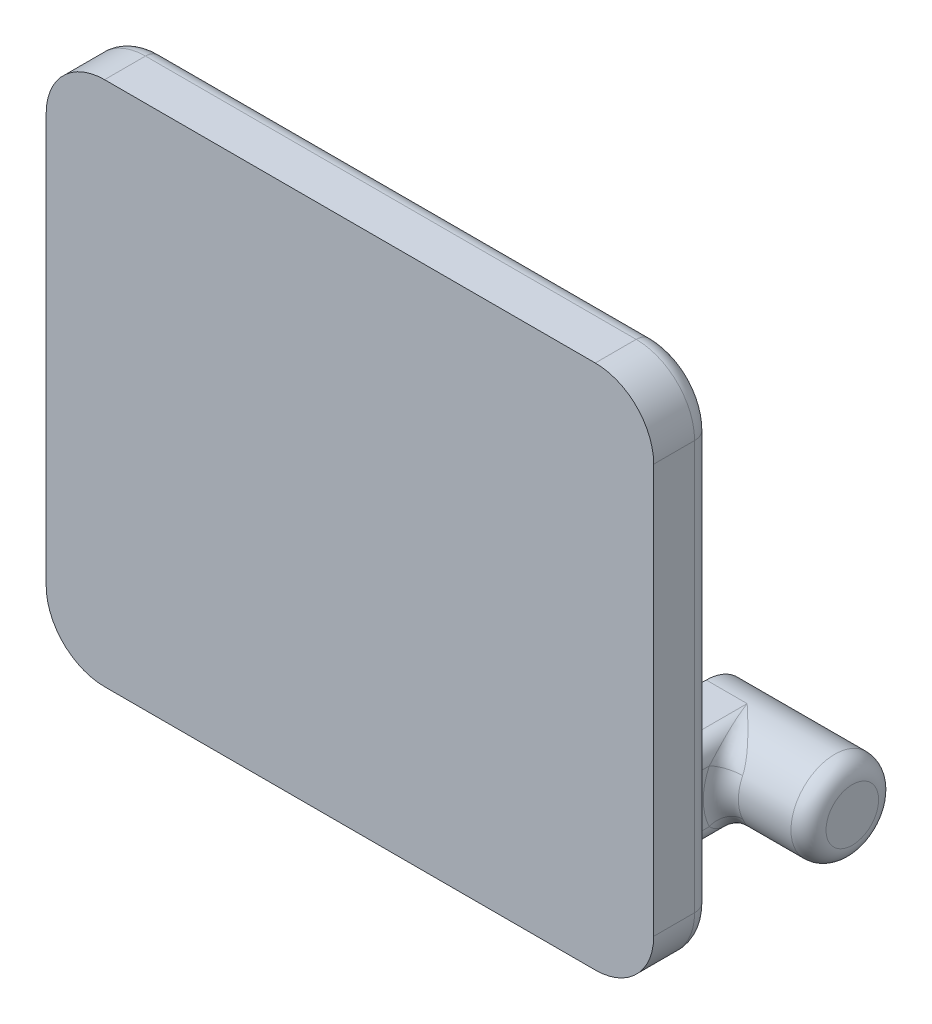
ISO-10303-21;
HEADER;
FILE_DESCRIPTION(('STEP AP214'),'2;1');
FILE_NAME('part.step','',(''),(''),'','','');
FILE_SCHEMA(('AUTOMOTIVE_DESIGN { 1 0 10303 214 1 1 1 1 }'));
ENDSEC;
DATA;
#1=APPLICATION_CONTEXT('core data for automotive mechanical design processes');
#2=APPLICATION_PROTOCOL_DEFINITION('international standard','automotive_design',2000,#1);
#3=PRODUCT_CONTEXT('',#1,'mechanical');
#4=PRODUCT('Part','Part','',(#3));
#5=PRODUCT_RELATED_PRODUCT_CATEGORY('part','',(#4));
#6=PRODUCT_DEFINITION_FORMATION('','',#4);
#7=PRODUCT_DEFINITION_CONTEXT('part definition',#1,'design');
#8=PRODUCT_DEFINITION('design','',#6,#7);
#9=PRODUCT_DEFINITION_SHAPE('','',#8);
#10=(LENGTH_UNIT() NAMED_UNIT(*) SI_UNIT(.MILLI.,.METRE.));
#11=(NAMED_UNIT(*) PLANE_ANGLE_UNIT() SI_UNIT($,.RADIAN.));
#12=(NAMED_UNIT(*) SI_UNIT($,.STERADIAN.) SOLID_ANGLE_UNIT());
#13=UNCERTAINTY_MEASURE_WITH_UNIT(LENGTH_MEASURE(1.E-05),#10,'distance_accuracy_value','');
#14=(GEOMETRIC_REPRESENTATION_CONTEXT(3) GLOBAL_UNCERTAINTY_ASSIGNED_CONTEXT((#13)) GLOBAL_UNIT_ASSIGNED_CONTEXT((#10,
#11,#12)) REPRESENTATION_CONTEXT('',''));
#15=CARTESIAN_POINT('',(0.,0.,0.));
#16=DIRECTION('',(0.,0.,1.));
#17=DIRECTION('',(1.,0.,0.));
#18=AXIS2_PLACEMENT_3D('',#15,#16,#17);
#19=CARTESIAN_POINT('',(0.,0.,0.));
#20=DIRECTION('',(0.,0.,1.));
#21=DIRECTION('',(1.,0.,0.));
#22=AXIS2_PLACEMENT_3D('',#19,#20,#21);
#23=PLANE('',#22);
#24=DIRECTION('',(0.,-1.,0.));
#25=VECTOR('',#24,1.);
#26=CARTESIAN_POINT('',(13.5,-13.25,0.));
#27=LINE('',#26,#25);
#28=CARTESIAN_POINT('',(13.5,-11.75,0.));
#29=VERTEX_POINT('',#28);
#30=CARTESIAN_POINT('',(13.5,-21.,0.));
#31=VERTEX_POINT('',#30);
#32=EDGE_CURVE('E61',#29,#31,#27,.T.);
#33=ORIENTED_EDGE('',*,*,#32,.T.);
#34=DIRECTION('',(1.,0.,0.));
#35=VECTOR('',#34,1.);
#36=CARTESIAN_POINT('',(0.,-21.,0.));
#37=LINE('',#36,#35);
#38=CARTESIAN_POINT('',(-21.,-21.,0.));
#39=VERTEX_POINT('',#38);
#40=EDGE_CURVE('E1132',#31,#39,#37,.F.);
#41=ORIENTED_EDGE('',*,*,#40,.T.);
#42=CARTESIAN_POINT('',(-21.,-17.5,0.));
#43=DIRECTION('',(0.,0.,1.));
#44=DIRECTION('',(1.,0.,0.));
#45=AXIS2_PLACEMENT_3D('',#42,#43,#44);
#46=CIRCLE('',#45,3.5);
#47=CARTESIAN_POINT('',(-23.872281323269,-19.5,0.));
#48=VERTEX_POINT('',#47);
#49=EDGE_CURVE('E1136',#39,#48,#46,.F.);
#50=ORIENTED_EDGE('',*,*,#49,.T.);
#51=DIRECTION('',(-1.,0.,0.));
#52=VECTOR('',#51,1.);
#53=CARTESIAN_POINT('',(-21.,-19.5,0.));
#54=LINE('',#53,#52);
#55=CARTESIAN_POINT('',(-19.5,-19.5,0.));
#56=VERTEX_POINT('',#55);
#57=EDGE_CURVE('E1269',#56,#48,#54,.T.);
#58=ORIENTED_EDGE('',*,*,#57,.F.);
#59=DIRECTION('',(0.,1.,0.));
#60=VECTOR('',#59,1.);
#61=CARTESIAN_POINT('',(-19.5,-11.5,0.));
#62=LINE('',#61,#60);
#63=CARTESIAN_POINT('',(-19.5,-10.,0.));
#64=VERTEX_POINT('',#63);
#65=EDGE_CURVE('E1118',#56,#64,#62,.T.);
#66=ORIENTED_EDGE('',*,*,#65,.T.);
#67=DIRECTION('',(-1.,0.,0.));
#68=VECTOR('',#67,1.);
#69=CARTESIAN_POINT('',(0.,-9.99999999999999,0.));
#70=LINE('',#69,#68);
#71=CARTESIAN_POINT('',(-24.5,-10.,0.));
#72=VERTEX_POINT('',#71);
#73=EDGE_CURVE('E1116',#64,#72,#70,.T.);
#74=ORIENTED_EDGE('',*,*,#73,.T.);
#75=DIRECTION('',(0.,-1.,0.));
#76=VECTOR('',#75,1.);
#77=CARTESIAN_POINT('',(-24.5,0.,0.));
#78=LINE('',#77,#76);
#79=CARTESIAN_POINT('',(-24.5,17.5,0.));
#80=VERTEX_POINT('',#79);
#81=EDGE_CURVE('E1120',#72,#80,#78,.F.);
#82=ORIENTED_EDGE('',*,*,#81,.T.);
#83=CARTESIAN_POINT('',(-21.,17.5,0.));
#84=DIRECTION('',(0.,0.,1.));
#85=DIRECTION('',(1.,0.,0.));
#86=AXIS2_PLACEMENT_3D('',#83,#84,#85);
#87=CIRCLE('',#86,3.5);
#88=CARTESIAN_POINT('',(-21.,21.,0.));
#89=VERTEX_POINT('',#88);
#90=EDGE_CURVE('E1122',#80,#89,#87,.F.);
#91=ORIENTED_EDGE('',*,*,#90,.T.);
#92=DIRECTION('',(-1.,0.,0.));
#93=VECTOR('',#92,1.);
#94=CARTESIAN_POINT('',(0.,21.,0.));
#95=LINE('',#94,#93);
#96=CARTESIAN_POINT('',(21.,21.,0.));
#97=VERTEX_POINT('',#96);
#98=EDGE_CURVE('E1124',#89,#97,#95,.F.);
#99=ORIENTED_EDGE('',*,*,#98,.T.);
#100=CARTESIAN_POINT('',(21.,17.5,0.));
#101=DIRECTION('',(0.,0.,1.));
#102=DIRECTION('',(1.,0.,0.));
#103=AXIS2_PLACEMENT_3D('',#100,#101,#102);
#104=CIRCLE('',#103,3.5);
#105=CARTESIAN_POINT('',(24.5,17.5,0.));
#106=VERTEX_POINT('',#105);
#107=EDGE_CURVE('E1126',#97,#106,#104,.F.);
#108=ORIENTED_EDGE('',*,*,#107,.T.);
#109=DIRECTION('',(0.,1.,0.));
#110=VECTOR('',#109,1.);
#111=CARTESIAN_POINT('',(24.5,0.,0.));
#112=LINE('',#111,#110);
#113=CARTESIAN_POINT('',(24.5,-17.5,0.));
#114=VERTEX_POINT('',#113);
#115=EDGE_CURVE('E1128',#106,#114,#112,.F.);
#116=ORIENTED_EDGE('',*,*,#115,.T.);
#117=CARTESIAN_POINT('',(21.,-17.5,0.));
#118=DIRECTION('',(0.,0.,1.));
#119=DIRECTION('',(1.,0.,0.));
#120=AXIS2_PLACEMENT_3D('',#117,#118,#119);
#121=CIRCLE('',#120,3.5);
#122=CARTESIAN_POINT('',(21.,-21.,0.));
#123=VERTEX_POINT('',#122);
#124=EDGE_CURVE('E1130',#114,#123,#121,.F.);
#125=ORIENTED_EDGE('',*,*,#124,.T.);
#126=CARTESIAN_POINT('',(19.4366985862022,-21.,0.));
#127=VERTEX_POINT('',#126);
#128=EDGE_CURVE('E1133',#123,#127,#37,.F.);
#129=ORIENTED_EDGE('',*,*,#128,.T.);
#130=CARTESIAN_POINT('',(17.,-19.25,0.));
#131=DIRECTION('',(0.,0.,1.));
#132=DIRECTION('',(1.,0.,0.));
#133=AXIS2_PLACEMENT_3D('',#130,#131,#132);
#134=CIRCLE('',#133,3.);
#135=CARTESIAN_POINT('',(20.,-19.25,0.));
#136=VERTEX_POINT('',#135);
#137=EDGE_CURVE('E289',#127,#136,#134,.T.);
#138=ORIENTED_EDGE('',*,*,#137,.T.);
#139=DIRECTION('',(0.,-1.,0.));
#140=VECTOR('',#139,1.);
#141=CARTESIAN_POINT('',(20.,-13.25,0.));
#142=LINE('',#141,#140);
#143=CARTESIAN_POINT('',(20.,-14.75,0.));
#144=VERTEX_POINT('',#143);
#145=EDGE_CURVE('E558',#136,#144,#142,.F.);
#146=ORIENTED_EDGE('',*,*,#145,.T.);
#147=CARTESIAN_POINT('',(17.,-14.75,0.));
#148=DIRECTION('',(0.,0.,1.));
#149=DIRECTION('',(1.,0.,0.));
#150=AXIS2_PLACEMENT_3D('',#147,#148,#149);
#151=CIRCLE('',#150,3.);
#152=CARTESIAN_POINT('',(17.,-11.75,0.));
#153=VERTEX_POINT('',#152);
#154=EDGE_CURVE('E555',#153,#144,#151,.F.);
#155=ORIENTED_EDGE('',*,*,#154,.F.);
#156=DIRECTION('',(1.,0.,0.));
#157=VECTOR('',#156,1.);
#158=CARTESIAN_POINT('',(0.,-11.75,0.));
#159=LINE('',#158,#157);
#160=EDGE_CURVE('E561',#153,#29,#159,.F.);
#161=ORIENTED_EDGE('',*,*,#160,.T.);
#162=EDGE_LOOP('',(#33,#41,#50,#58,#66,#74,#82,#91,#99,#108,#116,#125,#129,#138,#146,#155,#161));
#163=FACE_BOUND('',#162,.T.);
#164=ADVANCED_FACE('F43',(#163),#23,.F.);
#165=CARTESIAN_POINT('',(26.,22.5,5.));
#166=DIRECTION('',(-1.,0.,0.));
#167=DIRECTION('',(0.,-1.,0.));
#168=AXIS2_PLACEMENT_3D('',#165,#166,#167);
#169=PLANE('',#168);
#170=DIRECTION('',(0.,0.,-1.));
#171=VECTOR('',#170,1.);
#172=CARTESIAN_POINT('',(26.,-17.5,5.));
#173=LINE('',#172,#171);
#174=CARTESIAN_POINT('',(26.,-17.5,5.));
#175=VERTEX_POINT('',#174);
#176=CARTESIAN_POINT('',(26.,-17.5,1.5));
#177=VERTEX_POINT('',#176);
#178=EDGE_CURVE('E1086',#175,#177,#173,.T.);
#179=ORIENTED_EDGE('',*,*,#178,.T.);
#180=DIRECTION('',(0.,1.,0.));
#181=VECTOR('',#180,1.);
#182=CARTESIAN_POINT('',(26.,22.5,1.5));
#183=LINE('',#182,#181);
#184=CARTESIAN_POINT('',(26.,17.5,1.5));
#185=VERTEX_POINT('',#184);
#186=EDGE_CURVE('E1144',#177,#185,#183,.T.);
#187=ORIENTED_EDGE('',*,*,#186,.T.);
#188=DIRECTION('',(0.,0.,-1.));
#189=VECTOR('',#188,1.);
#190=CARTESIAN_POINT('',(26.,17.5,5.));
#191=LINE('',#190,#189);
#192=CARTESIAN_POINT('',(26.,17.5,5.));
#193=VERTEX_POINT('',#192);
#194=EDGE_CURVE('E1083',#185,#193,#191,.F.);
#195=ORIENTED_EDGE('',*,*,#194,.T.);
#196=DIRECTION('',(0.,1.,0.));
#197=VECTOR('',#196,1.);
#198=CARTESIAN_POINT('',(26.,22.5,5.));
#199=LINE('',#198,#197);
#200=EDGE_CURVE('E1275',#175,#193,#199,.T.);
#201=ORIENTED_EDGE('',*,*,#200,.F.);
#202=EDGE_LOOP('',(#179,#187,#195,#201));
#203=FACE_BOUND('',#202,.T.);
#204=ADVANCED_FACE('F437',(#203),#169,.F.);
#205=CARTESIAN_POINT('',(-26.,22.5,5.));
#206=DIRECTION('',(0.,-1.,0.));
#207=DIRECTION('',(0.,0.,-1.));
#208=AXIS2_PLACEMENT_3D('',#205,#206,#207);
#209=PLANE('',#208);
#210=DIRECTION('',(0.,0.,-1.));
#211=VECTOR('',#210,1.);
#212=CARTESIAN_POINT('',(21.,22.5,5.));
#213=LINE('',#212,#211);
#214=CARTESIAN_POINT('',(21.,22.5,5.));
#215=VERTEX_POINT('',#214);
#216=CARTESIAN_POINT('',(21.,22.5,1.5));
#217=VERTEX_POINT('',#216);
#218=EDGE_CURVE('E1096',#215,#217,#213,.T.);
#219=ORIENTED_EDGE('',*,*,#218,.T.);
#220=DIRECTION('',(-1.,0.,0.));
#221=VECTOR('',#220,1.);
#222=CARTESIAN_POINT('',(-26.,22.5,1.5));
#223=LINE('',#222,#221);
#224=CARTESIAN_POINT('',(-21.,22.5,1.5));
#225=VERTEX_POINT('',#224);
#226=EDGE_CURVE('E1140',#217,#225,#223,.T.);
#227=ORIENTED_EDGE('',*,*,#226,.T.);
#228=DIRECTION('',(0.,0.,-1.));
#229=VECTOR('',#228,1.);
#230=CARTESIAN_POINT('',(-21.,22.5,5.));
#231=LINE('',#230,#229);
#232=CARTESIAN_POINT('',(-21.,22.5,5.));
#233=VERTEX_POINT('',#232);
#234=EDGE_CURVE('E1094',#225,#233,#231,.F.);
#235=ORIENTED_EDGE('',*,*,#234,.T.);
#236=DIRECTION('',(-1.,0.,0.));
#237=VECTOR('',#236,1.);
#238=CARTESIAN_POINT('',(-26.,22.5,5.));
#239=LINE('',#238,#237);
#240=EDGE_CURVE('E1075',#215,#233,#239,.T.);
#241=ORIENTED_EDGE('',*,*,#240,.F.);
#242=EDGE_LOOP('',(#219,#227,#235,#241));
#243=FACE_BOUND('',#242,.T.);
#244=ADVANCED_FACE('F442',(#243),#209,.F.);
#245=CARTESIAN_POINT('',(-26.,22.5,5.));
#246=DIRECTION('',(1.,0.,0.));
#247=DIRECTION('',(0.,1.,0.));
#248=AXIS2_PLACEMENT_3D('',#245,#246,#247);
#249=PLANE('',#248);
#250=CARTESIAN_POINT('',(-26.,-10.,-1.5));
#251=DIRECTION('',(1.,0.,0.));
#252=DIRECTION('',(0.,1.,0.));
#253=AXIS2_PLACEMENT_3D('',#250,#251,#252);
#254=CIRCLE('',#253,3.);
#255=CARTESIAN_POINT('',(-26.,-13.,-1.5));
#256=VERTEX_POINT('',#255);
#257=CARTESIAN_POINT('',(-26.,-10.,1.5));
#258=VERTEX_POINT('',#257);
#259=EDGE_CURVE('E1101',#256,#258,#254,.F.);
#260=ORIENTED_EDGE('',*,*,#259,.F.);
#261=DIRECTION('',(0.,0.,-1.));
#262=VECTOR('',#261,1.);
#263=CARTESIAN_POINT('',(-26.,-13.,-10.));
#264=LINE('',#263,#262);
#265=CARTESIAN_POINT('',(-26.,-13.,-10.));
#266=VERTEX_POINT('',#265);
#267=EDGE_CURVE('E1106',#256,#266,#264,.T.);
#268=ORIENTED_EDGE('',*,*,#267,.T.);
#269=DIRECTION('',(0.,-1.,0.));
#270=VECTOR('',#269,1.);
#271=CARTESIAN_POINT('',(-26.,-11.5,-10.));
#272=LINE('',#271,#270);
#273=CARTESIAN_POINT('',(-26.,-18.,-10.));
#274=VERTEX_POINT('',#273);
#275=EDGE_CURVE('E1303',#266,#274,#272,.T.);
#276=ORIENTED_EDGE('',*,*,#275,.T.);
#277=DIRECTION('',(0.,0.,1.));
#278=VECTOR('',#277,1.);
#279=CARTESIAN_POINT('',(-26.,-18.,0.));
#280=LINE('',#279,#278);
#281=CARTESIAN_POINT('',(-26.,-18.,0.));
#282=VERTEX_POINT('',#281);
#283=EDGE_CURVE('E1099',#274,#282,#280,.T.);
#284=ORIENTED_EDGE('',*,*,#283,.T.);
#285=DIRECTION('',(0.,1.,0.));
#286=VECTOR('',#285,1.);
#287=CARTESIAN_POINT('',(-26.,-11.5,0.));
#288=LINE('',#287,#286);
#289=CARTESIAN_POINT('',(-26.,-17.5,0.));
#290=VERTEX_POINT('',#289);
#291=EDGE_CURVE('E548',#282,#290,#288,.T.);
#292=ORIENTED_EDGE('',*,*,#291,.T.);
#293=DIRECTION('',(0.,0.,-1.));
#294=VECTOR('',#293,1.);
#295=CARTESIAN_POINT('',(-26.,-17.5,5.));
#296=LINE('',#295,#294);
#297=CARTESIAN_POINT('',(-26.,-17.5,5.));
#298=VERTEX_POINT('',#297);
#299=EDGE_CURVE('E1080',#290,#298,#296,.F.);
#300=ORIENTED_EDGE('',*,*,#299,.T.);
#301=DIRECTION('',(0.,-1.,0.));
#302=VECTOR('',#301,1.);
#303=CARTESIAN_POINT('',(-26.,22.5,5.));
#304=LINE('',#303,#302);
#305=CARTESIAN_POINT('',(-26.,17.5,5.));
#306=VERTEX_POINT('',#305);
#307=EDGE_CURVE('E1064',#306,#298,#304,.T.);
#308=ORIENTED_EDGE('',*,*,#307,.F.);
#309=DIRECTION('',(0.,0.,-1.));
#310=VECTOR('',#309,1.);
#311=CARTESIAN_POINT('',(-26.,17.5,5.));
#312=LINE('',#311,#310);
#313=CARTESIAN_POINT('',(-26.,17.5,1.5));
#314=VERTEX_POINT('',#313);
#315=EDGE_CURVE('E1307',#306,#314,#312,.T.);
#316=ORIENTED_EDGE('',*,*,#315,.T.);
#317=DIRECTION('',(0.,-1.,0.));
#318=VECTOR('',#317,1.);
#319=CARTESIAN_POINT('',(-26.,22.5,1.5));
#320=LINE('',#319,#318);
#321=EDGE_CURVE('E1104',#314,#258,#320,.T.);
#322=ORIENTED_EDGE('',*,*,#321,.T.);
#323=EDGE_LOOP('',(#260,#268,#276,#284,#292,#300,#308,#316,#322));
#324=FACE_BOUND('',#323,.T.);
#325=ADVANCED_FACE('F452',(#324),#249,.F.);
#326=CARTESIAN_POINT('',(-26.,-22.5,5.));
#327=DIRECTION('',(0.,1.,0.));
#328=DIRECTION('',(0.,0.,1.));
#329=AXIS2_PLACEMENT_3D('',#326,#327,#328);
#330=PLANE('',#329);
#331=DIRECTION('',(0.,0.,-1.));
#332=VECTOR('',#331,1.);
#333=CARTESIAN_POINT('',(-21.,-22.5,5.));
#334=LINE('',#333,#332);
#335=CARTESIAN_POINT('',(-21.,-22.5,5.));
#336=VERTEX_POINT('',#335);
#337=CARTESIAN_POINT('',(-21.,-22.5,1.5));
#338=VERTEX_POINT('',#337);
#339=EDGE_CURVE('E1082',#336,#338,#334,.T.);
#340=ORIENTED_EDGE('',*,*,#339,.T.);
#341=DIRECTION('',(1.,0.,0.));
#342=VECTOR('',#341,1.);
#343=CARTESIAN_POINT('',(-26.,-22.5,1.5));
#344=LINE('',#343,#342);
#345=CARTESIAN_POINT('',(21.,-22.5,1.5));
#346=VERTEX_POINT('',#345);
#347=EDGE_CURVE('E1148',#338,#346,#344,.T.);
#348=ORIENTED_EDGE('',*,*,#347,.T.);
#349=DIRECTION('',(0.,0.,-1.));
#350=VECTOR('',#349,1.);
#351=CARTESIAN_POINT('',(21.,-22.5,5.));
#352=LINE('',#351,#350);
#353=CARTESIAN_POINT('',(21.,-22.5,5.));
#354=VERTEX_POINT('',#353);
#355=EDGE_CURVE('E1325',#346,#354,#352,.F.);
#356=ORIENTED_EDGE('',*,*,#355,.T.);
#357=DIRECTION('',(1.,0.,0.));
#358=VECTOR('',#357,1.);
#359=CARTESIAN_POINT('',(-26.,-22.5,5.));
#360=LINE('',#359,#358);
#361=EDGE_CURVE('E1074',#336,#354,#360,.T.);
#362=ORIENTED_EDGE('',*,*,#361,.F.);
#363=EDGE_LOOP('',(#340,#348,#356,#362));
#364=FACE_BOUND('',#363,.T.);
#365=ADVANCED_FACE('F449',(#364),#330,.F.);
#366=CARTESIAN_POINT('',(0.,0.,5.));
#367=DIRECTION('',(0.,0.,1.));
#368=DIRECTION('',(1.,0.,0.));
#369=AXIS2_PLACEMENT_3D('',#366,#367,#368);
#370=PLANE('',#369);
#371=ORIENTED_EDGE('',*,*,#307,.T.);
#372=CARTESIAN_POINT('',(-21.,-17.5,5.));
#373=DIRECTION('',(0.,0.,1.));
#374=DIRECTION('',(1.,0.,0.));
#375=AXIS2_PLACEMENT_3D('',#372,#373,#374);
#376=CIRCLE('',#375,5.);
#377=EDGE_CURVE('E1067',#298,#336,#376,.T.);
#378=ORIENTED_EDGE('',*,*,#377,.T.);
#379=ORIENTED_EDGE('',*,*,#361,.T.);
#380=CARTESIAN_POINT('',(21.,-17.5,5.));
#381=DIRECTION('',(0.,0.,1.));
#382=DIRECTION('',(1.,0.,0.));
#383=AXIS2_PLACEMENT_3D('',#380,#381,#382);
#384=CIRCLE('',#383,5.);
#385=EDGE_CURVE('E1084',#354,#175,#384,.T.);
#386=ORIENTED_EDGE('',*,*,#385,.T.);
#387=ORIENTED_EDGE('',*,*,#200,.T.);
#388=CARTESIAN_POINT('',(21.,17.5,5.));
#389=DIRECTION('',(0.,0.,1.));
#390=DIRECTION('',(1.,0.,0.));
#391=AXIS2_PLACEMENT_3D('',#388,#389,#390);
#392=CIRCLE('',#391,5.);
#393=EDGE_CURVE('E1088',#193,#215,#392,.T.);
#394=ORIENTED_EDGE('',*,*,#393,.T.);
#395=ORIENTED_EDGE('',*,*,#240,.T.);
#396=CARTESIAN_POINT('',(-21.,17.5,5.));
#397=DIRECTION('',(0.,0.,1.));
#398=DIRECTION('',(1.,0.,0.));
#399=AXIS2_PLACEMENT_3D('',#396,#397,#398);
#400=CIRCLE('',#399,5.);
#401=EDGE_CURVE('E1071',#233,#306,#400,.T.);
#402=ORIENTED_EDGE('',*,*,#401,.T.);
#403=EDGE_LOOP('',(#371,#378,#379,#386,#387,#394,#395,#402));
#404=FACE_BOUND('',#403,.T.);
#405=ADVANCED_FACE('F447',(#404),#370,.T.);
#406=CARTESIAN_POINT('',(-21.,-17.5,5.));
#407=DIRECTION('',(0.,0.,-1.));
#408=DIRECTION('',(-1.,0.,0.));
#409=AXIS2_PLACEMENT_3D('',#406,#407,#408);
#410=CYLINDRICAL_SURFACE('',#409,5.);
#411=DIRECTION('',(0.,0.,-1.));
#412=VECTOR('',#411,1.);
#413=CARTESIAN_POINT('',(-25.8804564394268,-18.5868049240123,0.));
#414=LINE('',#413,#412);
#415=CARTESIAN_POINT('',(-25.8804564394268,-18.5868049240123,0.));
#416=VERTEX_POINT('',#415);
#417=CARTESIAN_POINT('',(-25.8804564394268,-18.5868049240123,1.50000000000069));
#418=VERTEX_POINT('',#417);
#419=EDGE_CURVE('E1160',#416,#418,#414,.F.);
#420=ORIENTED_EDGE('',*,*,#419,.T.);
#421=CARTESIAN_POINT('',(-21.,-17.5,1.5));
#422=DIRECTION('',(0.,0.,1.));
#423=DIRECTION('',(1.,0.,0.));
#424=AXIS2_PLACEMENT_3D('',#421,#422,#423);
#425=CIRCLE('',#424,5.);
#426=EDGE_CURVE('E1162',#418,#338,#425,.T.);
#427=ORIENTED_EDGE('',*,*,#426,.T.);
#428=ORIENTED_EDGE('',*,*,#339,.F.);
#429=ORIENTED_EDGE('',*,*,#377,.F.);
#430=ORIENTED_EDGE('',*,*,#299,.F.);
#431=CARTESIAN_POINT('',(-21.,-17.5,0.));
#432=DIRECTION('',(0.,0.,1.));
#433=DIRECTION('',(1.,0.,0.));
#434=AXIS2_PLACEMENT_3D('',#431,#432,#433);
#435=CIRCLE('',#434,5.);
#436=EDGE_CURVE('E1308',#416,#290,#435,.F.);
#437=ORIENTED_EDGE('',*,*,#436,.F.);
#438=EDGE_LOOP('',(#420,#427,#428,#429,#430,#437));
#439=FACE_BOUND('',#438,.T.);
#440=ADVANCED_FACE('F460',(#439),#410,.T.);
#441=CARTESIAN_POINT('',(21.,-17.5,5.));
#442=DIRECTION('',(0.,0.,-1.));
#443=DIRECTION('',(-1.,0.,0.));
#444=AXIS2_PLACEMENT_3D('',#441,#442,#443);
#445=CYLINDRICAL_SURFACE('',#444,5.);
#446=ORIENTED_EDGE('',*,*,#355,.F.);
#447=CARTESIAN_POINT('',(21.,-17.5,1.5));
#448=DIRECTION('',(0.,0.,1.));
#449=DIRECTION('',(1.,0.,0.));
#450=AXIS2_PLACEMENT_3D('',#447,#448,#449);
#451=CIRCLE('',#450,5.);
#452=EDGE_CURVE('E1146',#346,#177,#451,.T.);
#453=ORIENTED_EDGE('',*,*,#452,.T.);
#454=ORIENTED_EDGE('',*,*,#178,.F.);
#455=ORIENTED_EDGE('',*,*,#385,.F.);
#456=EDGE_LOOP('',(#446,#453,#454,#455));
#457=FACE_BOUND('',#456,.T.);
#458=ADVANCED_FACE('F463',(#457),#445,.T.);
#459=CARTESIAN_POINT('',(21.,17.5,5.));
#460=DIRECTION('',(0.,0.,-1.));
#461=DIRECTION('',(-1.,0.,0.));
#462=AXIS2_PLACEMENT_3D('',#459,#460,#461);
#463=CYLINDRICAL_SURFACE('',#462,5.);
#464=ORIENTED_EDGE('',*,*,#194,.F.);
#465=CARTESIAN_POINT('',(21.,17.5,1.5));
#466=DIRECTION('',(0.,0.,1.));
#467=DIRECTION('',(1.,0.,0.));
#468=AXIS2_PLACEMENT_3D('',#465,#466,#467);
#469=CIRCLE('',#468,5.);
#470=EDGE_CURVE('E1142',#185,#217,#469,.T.);
#471=ORIENTED_EDGE('',*,*,#470,.T.);
#472=ORIENTED_EDGE('',*,*,#218,.F.);
#473=ORIENTED_EDGE('',*,*,#393,.F.);
#474=EDGE_LOOP('',(#464,#471,#472,#473));
#475=FACE_BOUND('',#474,.T.);
#476=ADVANCED_FACE('F467',(#475),#463,.T.);
#477=CARTESIAN_POINT('',(-21.,17.5,5.));
#478=DIRECTION('',(0.,0.,-1.));
#479=DIRECTION('',(-1.,0.,0.));
#480=AXIS2_PLACEMENT_3D('',#477,#478,#479);
#481=CYLINDRICAL_SURFACE('',#480,5.);
#482=ORIENTED_EDGE('',*,*,#234,.F.);
#483=CARTESIAN_POINT('',(-21.,17.5,1.5));
#484=DIRECTION('',(0.,0.,1.));
#485=DIRECTION('',(1.,0.,0.));
#486=AXIS2_PLACEMENT_3D('',#483,#484,#485);
#487=CIRCLE('',#486,5.);
#488=EDGE_CURVE('E1138',#225,#314,#487,.T.);
#489=ORIENTED_EDGE('',*,*,#488,.T.);
#490=ORIENTED_EDGE('',*,*,#315,.F.);
#491=ORIENTED_EDGE('',*,*,#401,.F.);
#492=EDGE_LOOP('',(#482,#489,#490,#491));
#493=FACE_BOUND('',#492,.T.);
#494=ADVANCED_FACE('F471',(#493),#481,.T.);
#495=CARTESIAN_POINT('',(-21.,-11.5,0.));
#496=DIRECTION('',(0.,0.,1.));
#497=DIRECTION('',(0.,-1.,0.));
#498=AXIS2_PLACEMENT_3D('',#495,#496,#497);
#499=PLANE('',#498);
#500=ORIENTED_EDGE('',*,*,#291,.F.);
#501=CARTESIAN_POINT('',(-24.5,-18.,0.));
#502=DIRECTION('',(0.,0.,1.));
#503=DIRECTION('',(0.,-1.,0.));
#504=AXIS2_PLACEMENT_3D('',#501,#502,#503);
#505=CIRCLE('',#504,1.5);
#506=EDGE_CURVE('E1164',#282,#416,#505,.T.);
#507=ORIENTED_EDGE('',*,*,#506,.T.);
#508=ORIENTED_EDGE('',*,*,#436,.T.);
#509=EDGE_LOOP('',(#500,#507,#508));
#510=FACE_BOUND('',#509,.T.);
#511=ADVANCED_FACE('F475',(#510),#499,.T.);
#512=CARTESIAN_POINT('',(-21.,-19.5,-10.));
#513=DIRECTION('',(0.,-1.,0.));
#514=DIRECTION('',(1.,0.,0.));
#515=AXIS2_PLACEMENT_3D('',#512,#513,#514);
#516=PLANE('',#515);
#517=CARTESIAN_POINT('',(-23.872281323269,-19.5,0.));
#518=CARTESIAN_POINT('',(-23.9255821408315,-19.5,-4.04088547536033E-06));
#519=CARTESIAN_POINT('',(-23.9788986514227,-19.5,0.00191375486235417));
#520=CARTESIAN_POINT('',(-24.0848984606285,-19.5,0.0097487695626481));
#521=CARTESIAN_POINT('',(-24.1375836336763,-19.5,0.0156408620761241));
#522=CARTESIAN_POINT('',(-24.2423565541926,-19.5,0.0315795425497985));
#523=CARTESIAN_POINT('',(-24.2944440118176,-19.5,0.0416280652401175));
#524=CARTESIAN_POINT('',(-24.397929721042,-19.5,0.0660826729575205));
#525=CARTESIAN_POINT('',(-24.4493215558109,-19.5,0.0805158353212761));
#526=CARTESIAN_POINT('',(-24.5,-19.5,0.0971806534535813));
#527=B_SPLINE_CURVE_WITH_KNOTS('',3,(#517,#518,#519,#520,#521,#522,#523,#524,#525,#526),
.UNSPECIFIED.,.F.,.F.,(4,2,2,2,4),(0.,0.159890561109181,0.318779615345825,0.477742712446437,
0.637708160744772),.UNSPECIFIED.);
#528=CARTESIAN_POINT('',(-24.5,-19.5,0.0971806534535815));
#529=VERTEX_POINT('',#528);
#530=EDGE_CURVE('E552',#48,#529,#527,.T.);
#531=ORIENTED_EDGE('',*,*,#530,.T.);
#532=DIRECTION('',(0.,0.,1.));
#533=VECTOR('',#532,1.);
#534=CARTESIAN_POINT('',(-24.5,-19.5,-10.));
#535=LINE('',#534,#533);
#536=CARTESIAN_POINT('',(-24.5,-19.5,-8.5));
#537=VERTEX_POINT('',#536);
#538=EDGE_CURVE('E1168',#529,#537,#535,.F.);
#539=ORIENTED_EDGE('',*,*,#538,.T.);
#540=DIRECTION('',(-1.,0.,0.));
#541=VECTOR('',#540,1.);
#542=CARTESIAN_POINT('',(-21.,-19.5,-8.5));
#543=LINE('',#542,#541);
#544=CARTESIAN_POINT('',(-21.,-19.5,-8.5));
#545=VERTEX_POINT('',#544);
#546=EDGE_CURVE('E1166',#537,#545,#543,.F.);
#547=ORIENTED_EDGE('',*,*,#546,.T.);
#548=DIRECTION('',(0.,0.,1.));
#549=VECTOR('',#548,1.);
#550=CARTESIAN_POINT('',(-21.,-19.5,-10.));
#551=LINE('',#550,#549);
#552=CARTESIAN_POINT('',(-21.,-19.5,-1.5));
#553=VERTEX_POINT('',#552);
#554=EDGE_CURVE('E1276',#545,#553,#551,.T.);
#555=ORIENTED_EDGE('',*,*,#554,.T.);
#556=CARTESIAN_POINT('',(-19.5,-19.5,-1.5));
#557=DIRECTION('',(0.,-1.,0.));
#558=DIRECTION('',(1.,0.,0.));
#559=AXIS2_PLACEMENT_3D('',#556,#557,#558);
#560=CIRCLE('',#559,1.5);
#561=EDGE_CURVE('E1170',#553,#56,#560,.F.);
#562=ORIENTED_EDGE('',*,*,#561,.T.);
#563=ORIENTED_EDGE('',*,*,#57,.T.);
#564=EDGE_LOOP('',(#531,#539,#547,#555,#562,#563));
#565=FACE_BOUND('',#564,.T.);
#566=ADVANCED_FACE('F889',(#565),#516,.T.);
#567=CARTESIAN_POINT('',(-21.,-11.5,-10.));
#568=DIRECTION('',(0.,0.,-1.));
#569=DIRECTION('',(0.,1.,0.));
#570=AXIS2_PLACEMENT_3D('',#567,#568,#569);
#571=PLANE('',#570);
#572=DIRECTION('',(0.,-1.,0.));
#573=VECTOR('',#572,1.);
#574=CARTESIAN_POINT('',(-22.5,-19.5,-10.));
#575=LINE('',#574,#573);
#576=CARTESIAN_POINT('',(-22.5,-13.,-10.));
#577=VERTEX_POINT('',#576);
#578=CARTESIAN_POINT('',(-22.5,-18.,-10.));
#579=VERTEX_POINT('',#578);
#580=EDGE_CURVE('E1156',#577,#579,#575,.T.);
#581=ORIENTED_EDGE('',*,*,#580,.T.);
#582=DIRECTION('',(-1.,0.,0.));
#583=VECTOR('',#582,1.);
#584=CARTESIAN_POINT('',(-21.,-18.,-10.));
#585=LINE('',#584,#583);
#586=EDGE_CURVE('E1158',#579,#274,#585,.T.);
#587=ORIENTED_EDGE('',*,*,#586,.T.);
#588=ORIENTED_EDGE('',*,*,#275,.F.);
#589=DIRECTION('',(-1.,0.,0.));
#590=VECTOR('',#589,1.);
#591=CARTESIAN_POINT('',(-21.,-13.,-10.));
#592=LINE('',#591,#590);
#593=EDGE_CURVE('E1154',#266,#577,#592,.F.);
#594=ORIENTED_EDGE('',*,*,#593,.T.);
#595=EDGE_LOOP('',(#581,#587,#588,#594));
#596=FACE_BOUND('',#595,.T.);
#597=ADVANCED_FACE('F879',(#596),#571,.T.);
#598=CARTESIAN_POINT('',(-21.,-11.5,-10.));
#599=DIRECTION('',(0.,1.,0.));
#600=DIRECTION('',(-1.,0.,0.));
#601=AXIS2_PLACEMENT_3D('',#598,#599,#600);
#602=PLANE('',#601);
#603=DIRECTION('',(0.,0.,-1.));
#604=VECTOR('',#603,1.);
#605=CARTESIAN_POINT('',(-21.,-11.5,-10.));
#606=LINE('',#605,#604);
#607=CARTESIAN_POINT('',(-21.,-11.5,-1.5));
#608=VERTEX_POINT('',#607);
#609=CARTESIAN_POINT('',(-21.,-11.5,-8.5));
#610=VERTEX_POINT('',#609);
#611=EDGE_CURVE('E1288',#608,#610,#606,.T.);
#612=ORIENTED_EDGE('',*,*,#611,.T.);
#613=DIRECTION('',(-1.,0.,0.));
#614=VECTOR('',#613,1.);
#615=CARTESIAN_POINT('',(-21.,-11.5,-8.5));
#616=LINE('',#615,#614);
#617=CARTESIAN_POINT('',(-24.5,-11.5,-8.5));
#618=VERTEX_POINT('',#617);
#619=EDGE_CURVE('E1114',#610,#618,#616,.T.);
#620=ORIENTED_EDGE('',*,*,#619,.T.);
#621=DIRECTION('',(0.,0.,-1.));
#622=VECTOR('',#621,1.);
#623=CARTESIAN_POINT('',(-24.5,-11.5,0.));
#624=LINE('',#623,#622);
#625=CARTESIAN_POINT('',(-24.5,-11.5,-1.5));
#626=VERTEX_POINT('',#625);
#627=EDGE_CURVE('E1111',#618,#626,#624,.F.);
#628=ORIENTED_EDGE('',*,*,#627,.T.);
#629=DIRECTION('',(-1.,0.,0.));
#630=VECTOR('',#629,1.);
#631=CARTESIAN_POINT('',(-21.,-11.5,-1.5));
#632=LINE('',#631,#630);
#633=EDGE_CURVE('E1109',#626,#608,#632,.F.);
#634=ORIENTED_EDGE('',*,*,#633,.T.);
#635=EDGE_LOOP('',(#612,#620,#628,#634));
#636=FACE_BOUND('',#635,.T.);
#637=ADVANCED_FACE('F870',(#636),#602,.T.);
#638=CARTESIAN_POINT('',(-21.,0.,0.));
#639=DIRECTION('',(-1.,0.,0.));
#640=DIRECTION('',(0.,0.,1.));
#641=AXIS2_PLACEMENT_3D('',#638,#639,#640);
#642=PLANE('',#641);
#643=ORIENTED_EDGE('',*,*,#611,.F.);
#644=DIRECTION('',(0.,1.,0.));
#645=VECTOR('',#644,1.);
#646=CARTESIAN_POINT('',(-21.,-19.5,-1.5));
#647=LINE('',#646,#645);
#648=EDGE_CURVE('E1152',#608,#553,#647,.F.);
#649=ORIENTED_EDGE('',*,*,#648,.T.);
#650=ORIENTED_EDGE('',*,*,#554,.F.);
#651=DIRECTION('',(0.,-1.,0.));
#652=VECTOR('',#651,1.);
#653=CARTESIAN_POINT('',(-21.,-11.5,-8.5));
#654=LINE('',#653,#652);
#655=EDGE_CURVE('E1150',#545,#610,#654,.F.);
#656=ORIENTED_EDGE('',*,*,#655,.T.);
#657=EDGE_LOOP('',(#643,#649,#650,#656));
#658=FACE_BOUND('',#657,.T.);
#659=ADVANCED_FACE('F860',(#658),#642,.F.);
#660=CARTESIAN_POINT('',(21.,-17.5,1.5));
#661=DIRECTION('',(0.,0.,1.));
#662=DIRECTION('',(1.,0.,0.));
#663=AXIS2_PLACEMENT_3D('',#660,#661,#662);
#664=TOROIDAL_SURFACE('',#663,3.5,1.5);
#665=CARTESIAN_POINT('',(21.,-21.,1.5));
#666=DIRECTION('',(-1.,0.,0.));
#667=DIRECTION('',(0.,0.,1.));
#668=AXIS2_PLACEMENT_3D('',#665,#666,#667);
#669=CIRCLE('',#668,1.5);
#670=EDGE_CURVE('E542',#123,#346,#669,.T.);
#671=ORIENTED_EDGE('',*,*,#670,.F.);
#672=ORIENTED_EDGE('',*,*,#124,.F.);
#673=CARTESIAN_POINT('',(24.5,-17.5,1.5));
#674=DIRECTION('',(0.,1.,0.));
#675=DIRECTION('',(0.,0.,1.));
#676=AXIS2_PLACEMENT_3D('',#673,#674,#675);
#677=CIRCLE('',#676,1.5);
#678=EDGE_CURVE('E545',#177,#114,#677,.T.);
#679=ORIENTED_EDGE('',*,*,#678,.F.);
#680=ORIENTED_EDGE('',*,*,#452,.F.);
#681=EDGE_LOOP('',(#671,#672,#679,#680));
#682=FACE_BOUND('',#681,.T.);
#683=ADVANCED_FACE('F851',(#682),#664,.T.);
#684=CARTESIAN_POINT('',(24.5,22.5,1.5));
#685=DIRECTION('',(0.,1.,0.));
#686=DIRECTION('',(-1.,0.,0.));
#687=AXIS2_PLACEMENT_3D('',#684,#685,#686);
#688=CYLINDRICAL_SURFACE('',#687,1.5);
#689=ORIENTED_EDGE('',*,*,#678,.T.);
#690=ORIENTED_EDGE('',*,*,#115,.F.);
#691=CARTESIAN_POINT('',(24.5,17.5,1.5));
#692=DIRECTION('',(0.,1.,0.));
#693=DIRECTION('',(0.,0.,1.));
#694=AXIS2_PLACEMENT_3D('',#691,#692,#693);
#695=CIRCLE('',#694,1.5);
#696=EDGE_CURVE('E539',#185,#106,#695,.T.);
#697=ORIENTED_EDGE('',*,*,#696,.F.);
#698=ORIENTED_EDGE('',*,*,#186,.F.);
#699=EDGE_LOOP('',(#689,#690,#697,#698));
#700=FACE_BOUND('',#699,.T.);
#701=ADVANCED_FACE('F583',(#700),#688,.T.);
#702=CARTESIAN_POINT('',(-26.,-21.,1.5));
#703=DIRECTION('',(1.,0.,0.));
#704=DIRECTION('',(0.,0.,-1.));
#705=AXIS2_PLACEMENT_3D('',#702,#703,#704);
#706=CYLINDRICAL_SURFACE('',#705,1.5);
#707=DIRECTION('',(1.,0.,0.));
#708=VECTOR('',#707,1.);
#709=CARTESIAN_POINT('',(-26.,-21.625,0.136410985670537));
#710=LINE('',#709,#708);
#711=CARTESIAN_POINT('',(13.5,-21.625,0.136410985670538));
#712=VERTEX_POINT('',#711);
#713=CARTESIAN_POINT('',(17.,-21.625,0.136410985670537));
#714=VERTEX_POINT('',#713);
#715=EDGE_CURVE('E566',#712,#714,#710,.T.);
#716=ORIENTED_EDGE('',*,*,#715,.T.);
#717=CARTESIAN_POINT('',(18.4002869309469,-19.7877699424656,-1.42320090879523));
#718=CARTESIAN_POINT('',(18.2775279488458,-20.107419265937,0.166533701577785));
#719=CARTESIAN_POINT('',(19.8005738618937,-20.6627699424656,0.038399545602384));
#720=CARTESIAN_POINT('',(18.3889445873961,-19.8173166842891,-1.43684288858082));
#721=CARTESIAN_POINT('',(18.2715162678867,-20.1028280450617,0.155818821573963));
#722=CARTESIAN_POINT('',(19.7778891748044,-20.6923166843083,0.0315785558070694));
#723=CARTESIAN_POINT('',(18.3765877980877,-19.8466839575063,-1.44849896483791));
#724=CARTESIAN_POINT('',(18.2664055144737,-20.099170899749,0.14390573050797));
#725=CARTESIAN_POINT('',(19.7531755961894,-20.7216839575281,0.0257505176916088));
#726=CARTESIAN_POINT('',(18.3499093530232,-19.9048004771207,-1.46808188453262));
#727=CARTESIAN_POINT('',(18.2570363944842,-20.0947566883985,0.118215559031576));
#728=CARTESIAN_POINT('',(19.6998187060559,-20.7798004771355,0.0159590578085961));
#729=CARTESIAN_POINT('',(18.3355894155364,-19.9335502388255,-1.47601196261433));
#730=CARTESIAN_POINT('',(18.2527834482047,-20.0939870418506,0.104478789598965));
#731=CARTESIAN_POINT('',(19.6711788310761,-20.8085502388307,0.0119940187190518));
#732=CARTESIAN_POINT('',(18.2899685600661,-20.018154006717,-1.494517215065));
#733=CARTESIAN_POINT('',(18.2399767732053,-20.0973979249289,0.0616657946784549));
#734=CARTESIAN_POINT('',(19.5799371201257,-20.8931540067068,0.00274139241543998));
#735=CARTESIAN_POINT('',(18.2558416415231,-20.0727943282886,-1.49999610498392));
#736=CARTESIAN_POINT('',(18.2312782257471,-20.1070435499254,0.0307335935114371));
#737=CARTESIAN_POINT('',(19.5116832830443,-20.9477943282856,1.94749250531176E-06));
#738=CARTESIAN_POINT('',(18.1707885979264,-20.1912251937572,-1.50000494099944));
#739=CARTESIAN_POINT('',(18.2023211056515,-20.1472608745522,-0.0381008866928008));
#740=CARTESIAN_POINT('',(19.3415771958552,-21.066225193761,-2.47048001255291E-06));
#741=CARTESIAN_POINT('',(18.1178122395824,-20.2535325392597,-1.49119949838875));
#742=CARTESIAN_POINT('',(18.1798942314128,-20.1821493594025,-0.0756612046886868));
#743=CARTESIAN_POINT('',(19.2356244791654,-21.1285325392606,0.00440025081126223));
#744=CARTESIAN_POINT('',(18.0027388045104,-20.3685568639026,-1.46247149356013));
#745=CARTESIAN_POINT('',(18.1126801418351,-20.2677708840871,-0.140331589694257));
#746=CARTESIAN_POINT('',(19.0054776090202,-21.2435568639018,0.0187642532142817));
#747=CARTESIAN_POINT('',(17.9406129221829,-20.4212423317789,-1.44251324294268));
#748=CARTESIAN_POINT('',(18.0685128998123,-20.3180353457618,-0.167657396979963));
#749=CARTESIAN_POINT('',(18.8812258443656,-21.2962423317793,0.0287433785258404));
#750=CARTESIAN_POINT('',(17.8093453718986,-20.5154862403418,-1.39817299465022));
#751=CARTESIAN_POINT('',(17.9573371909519,-20.4202505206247,-0.209953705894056));
#752=CARTESIAN_POINT('',(18.6186907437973,-21.3904862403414,0.0509135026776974));
#753=CARTESIAN_POINT('',(17.740243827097,-20.5571038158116,-1.37381572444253));
#754=CARTESIAN_POINT('',(17.890939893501,-20.4722576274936,-0.225365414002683));
#755=CARTESIAN_POINT('',(18.480487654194,-21.4321038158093,0.0630921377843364));
#756=CARTESIAN_POINT('',(17.5962404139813,-20.6287498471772,-1.32677298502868));
#757=CARTESIAN_POINT('',(17.7390286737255,-20.5673382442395,-0.246943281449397));
#758=CARTESIAN_POINT('',(18.1924808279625,-21.5037498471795,0.0866135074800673));
#759=CARTESIAN_POINT('',(17.5213466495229,-20.6587941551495,-1.30408526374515));
#760=CARTESIAN_POINT('',(17.6535650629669,-20.610868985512,-0.253382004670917));
#761=CARTESIAN_POINT('',(18.0426932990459,-21.5337941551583,0.0979573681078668));
#762=CARTESIAN_POINT('',(17.3728238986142,-20.7048560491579,-1.26719332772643));
#763=CARTESIAN_POINT('',(17.4758919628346,-20.67921872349,-0.261022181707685));
#764=CARTESIAN_POINT('',(17.7456477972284,-21.5798560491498,0.116403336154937));
#765=CARTESIAN_POINT('',(17.2994905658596,-20.7217262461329,-1.25249675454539));
#766=CARTESIAN_POINT('',(17.3843179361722,-20.7055437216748,-0.26265040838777));
#767=CARTESIAN_POINT('',(17.5989811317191,-21.5967262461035,0.123751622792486));
#768=CARTESIAN_POINT('',(17.1507492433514,-20.7442953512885,-1.23249785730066));
#769=CARTESIAN_POINT('',(17.1954408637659,-20.7407923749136,-0.264459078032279));
#770=CARTESIAN_POINT('',(17.3014984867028,-21.6192953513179,0.133751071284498));
#771=CARTESIAN_POINT('',(17.0753414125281,-20.7499951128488,-1.227194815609));
#772=CARTESIAN_POINT('',(17.0974961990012,-20.749974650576,-0.264656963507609));
#773=CARTESIAN_POINT('',(17.1506828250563,-21.6249951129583,0.136402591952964));
#774=CARTESIAN_POINT('',(16.9591991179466,-20.7500026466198,-1.22716893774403));
#775=CARTESIAN_POINT('',(16.9472015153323,-20.7500137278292,-0.264637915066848));
#776=CARTESIAN_POINT('',(16.9183982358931,-21.6250026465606,0.136415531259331));
#777=CARTESIAN_POINT('',(16.9184177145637,-20.748335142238,-1.22871016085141));
#778=CARTESIAN_POINT('',(16.8943662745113,-20.7473456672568,-0.264569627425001));
#779=CARTESIAN_POINT('',(16.8368354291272,-21.6233351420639,0.13564491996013));
#780=CARTESIAN_POINT('',(16.8371607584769,-20.7416912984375,-1.23474458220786));
#781=CARTESIAN_POINT('',(16.7897819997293,-20.7368395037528,-0.264189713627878));
#782=CARTESIAN_POINT('',(16.6743215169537,-21.6166912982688,0.132627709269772));
#783=CARTESIAN_POINT('',(16.7966852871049,-20.7367141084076,-1.2392385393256));
#784=CARTESIAN_POINT('',(16.7379208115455,-20.7289770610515,-0.263877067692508));
#785=CARTESIAN_POINT('',(16.5933705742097,-21.6117141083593,0.130380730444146));
#786=CARTESIAN_POINT('',(16.7162309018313,-20.7234800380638,-1.25090904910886));
#787=CARTESIAN_POINT('',(16.6360916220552,-20.7083527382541,-0.262759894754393));
#788=CARTESIAN_POINT('',(16.4324618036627,-21.5984800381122,0.12454547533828));
#789=CARTESIAN_POINT('',(16.6762542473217,-20.7152116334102,-1.25809502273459));
#790=CARTESIAN_POINT('',(16.5860322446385,-20.6955301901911,-0.261950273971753));
#791=CARTESIAN_POINT('',(16.3525084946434,-21.5902116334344,0.120952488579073));
#792=CARTESIAN_POINT('',(16.597227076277,-20.6954877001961,-1.27463560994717));
#793=CARTESIAN_POINT('',(16.4888453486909,-20.665578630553,-0.259430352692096));
#794=CARTESIAN_POINT('',(16.194454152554,-21.5704877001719,0.112682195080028));
#795=CARTESIAN_POINT('',(16.5581761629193,-20.6840335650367,-1.28398927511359));
#796=CARTESIAN_POINT('',(16.4416390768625,-20.6483936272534,-0.257712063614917));
#797=CARTESIAN_POINT('',(16.1163523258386,-21.5590335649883,0.108005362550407));
#798=CARTESIAN_POINT('',(16.519712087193,-20.6710290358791,-1.29417414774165));
#799=CARTESIAN_POINT('',(16.3965541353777,-20.6294033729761,-0.255335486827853));
#800=CARTESIAN_POINT('',(16.039424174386,-21.5460290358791,0.102912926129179));
#801=(BOUNDED_SURFACE() B_SPLINE_SURFACE(3,2,((#717,#718,#719),(#720,#721,#722),(#723,#724,
#725),(#726,#727,#728),(#729,#730,#731),(#732,#733,#734),(#735,#736,#737),(#738,#739,#740),
(#741,#742,#743),(#744,#745,#746),(#747,#748,#749),(#750,#751,#752),(#753,#754,#755),(#756,#757,
#758),(#759,#760,#761),(#762,#763,#764),(#765,#766,#767),(#768,#769,#770),(#771,#772,#773),
(#774,#775,#776),(#777,#778,#779),(#780,#781,#782),(#783,#784,#785),(#786,#787,#788),(#789,#790,
#791),(#792,#793,#794),(#795,#796,#797),(#798,#799,#800)),.UNSPECIFIED.,.F.,.F.,
.F.) B_SPLINE_SURFACE_WITH_KNOTS((4,2,2,2,2,2,2,2,2,2,2,2,2,4),(3,3),(0.,0.194128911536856,
0.388088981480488,0.773215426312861,1.26176528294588,1.75188750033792,2.23933588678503,
2.72611421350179,3.17792291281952,3.62969709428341,3.87435384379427,4.11907349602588,
4.36465769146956,4.61013463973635),(0.,1.),
.UNSPECIFIED.) GEOMETRIC_REPRESENTATION_ITEM() RATIONAL_B_SPLINE_SURFACE(((1.,0.678011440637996,
1.),(1.,0.678977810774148,1.),(1.,0.680375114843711,1.),(1.,0.683941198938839,1.),(1.,
0.686109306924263,1.),(1.,0.69360209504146,1.),(1.,0.699931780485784,1.),(1.,0.716208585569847,
1.),(1.,0.726670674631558,1.),(1.,0.748276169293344,1.),(1.,0.759421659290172,1.),(1.,
0.780662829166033,1.),(1.,0.790763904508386,1.),(1.,0.808789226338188,1.),(1.,0.816716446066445,
1.),(1.,0.829093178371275,1.),(1.,0.833751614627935,1.),(1.,0.840016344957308,1.),(1.,
0.841622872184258,1.),(1.,0.841626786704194,1.),(1.,0.841157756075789,1.),(1.,0.83929931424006,
1.),(1.,0.837909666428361,1.),(1.,0.834241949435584,1.),(1.,0.831960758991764,1.),(1.,
0.826582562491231,1.),(1.,0.823485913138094,1.),(1.,0.820016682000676,1.))) REPRESENTATION_ITEM('') SURFACE());
#802=CARTESIAN_POINT('',(16.039424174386,-21.5460290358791,0.102912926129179));
#803=CARTESIAN_POINT('',(16.1163523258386,-21.5590335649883,0.108005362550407));
#804=CARTESIAN_POINT('',(16.194454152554,-21.5704877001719,0.112682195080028));
#805=CARTESIAN_POINT('',(16.3525084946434,-21.5902116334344,0.120952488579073));
#806=CARTESIAN_POINT('',(16.4324618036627,-21.5984800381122,0.12454547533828));
#807=CARTESIAN_POINT('',(16.5933705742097,-21.6117141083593,0.130380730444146));
#808=CARTESIAN_POINT('',(16.6743215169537,-21.6166912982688,0.132627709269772));
#809=CARTESIAN_POINT('',(16.8368354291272,-21.6233351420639,0.13564491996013));
#810=CARTESIAN_POINT('',(16.9183982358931,-21.6250026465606,0.136415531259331));
#811=CARTESIAN_POINT('',(17.1506828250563,-21.6249951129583,0.136402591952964));
#812=CARTESIAN_POINT('',(17.3014984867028,-21.6192953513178,0.133751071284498));
#813=CARTESIAN_POINT('',(17.5989811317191,-21.5967262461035,0.123751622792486));
#814=CARTESIAN_POINT('',(17.7456477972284,-21.5798560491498,0.116403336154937));
#815=CARTESIAN_POINT('',(18.0426932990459,-21.5337941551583,0.0979573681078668));
#816=CARTESIAN_POINT('',(18.1924808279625,-21.5037498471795,0.0866135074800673));
#817=CARTESIAN_POINT('',(18.480487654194,-21.4321038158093,0.0630921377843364));
#818=CARTESIAN_POINT('',(18.6186907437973,-21.3904862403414,0.0509135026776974));
#819=CARTESIAN_POINT('',(18.8812258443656,-21.2962423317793,0.0287433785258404));
#820=CARTESIAN_POINT('',(19.0054776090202,-21.2435568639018,0.0187642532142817));
#821=CARTESIAN_POINT('',(19.2356244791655,-21.1285325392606,0.00440025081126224));
#822=CARTESIAN_POINT('',(19.3415771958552,-21.066225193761,-2.47048001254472E-06));
#823=CARTESIAN_POINT('',(19.5116832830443,-20.9477943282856,1.94749250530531E-06));
#824=CARTESIAN_POINT('',(19.5799371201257,-20.8931540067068,0.00274139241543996));
#825=CARTESIAN_POINT('',(19.6711788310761,-20.8085502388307,0.0119940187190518));
#826=CARTESIAN_POINT('',(19.6998187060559,-20.7798004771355,0.0159590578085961));
#827=CARTESIAN_POINT('',(19.7531755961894,-20.7216839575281,0.0257505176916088));
#828=CARTESIAN_POINT('',(19.7778891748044,-20.6923166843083,0.0315785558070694));
#829=CARTESIAN_POINT('',(19.8005738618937,-20.6627699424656,0.038399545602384));
#830=B_SPLINE_CURVE_WITH_KNOTS('',3,(#802,#803,#804,#805,#806,#807,#808,#809,#810,#811,#812,
#813,#814,#815,#816,#817,#818,#819,#820,#821,#822,#823,#824,#825,#826,#827,#828,#829),
.UNSPECIFIED.,.F.,.F.,(4,2,2,2,2,2,2,2,2,2,2,2,2,4),(0.,0.245476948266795,0.491061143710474,
0.735780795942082,0.980437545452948,1.43221172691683,1.88402042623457,2.37079875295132,
2.85824713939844,3.34836935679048,3.83691921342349,4.22204565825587,4.4160057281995,
4.61013463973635),.UNSPECIFIED.);
#831=EDGE_CURVE('E568',#714,#127,#830,.T.);
#832=ORIENTED_EDGE('',*,*,#831,.T.);
#833=ORIENTED_EDGE('',*,*,#128,.F.);
#834=ORIENTED_EDGE('',*,*,#670,.T.);
#835=ORIENTED_EDGE('',*,*,#347,.F.);
#836=CARTESIAN_POINT('',(-21.,-21.,1.5));
#837=DIRECTION('',(-1.,0.,0.));
#838=DIRECTION('',(0.,0.,1.));
#839=AXIS2_PLACEMENT_3D('',#836,#837,#838);
#840=CIRCLE('',#839,1.5);
#841=EDGE_CURVE('E536',#39,#338,#840,.T.);
#842=ORIENTED_EDGE('',*,*,#841,.F.);
#843=ORIENTED_EDGE('',*,*,#40,.F.);
#844=CARTESIAN_POINT('',(13.5,-21.,1.5));
#845=DIRECTION('',(-1.,0.,0.));
#846=DIRECTION('',(0.,-1.,0.));
#847=AXIS2_PLACEMENT_3D('',#844,#845,#846);
#848=CIRCLE('',#847,1.5);
#849=EDGE_CURVE('E563',#31,#712,#848,.T.);
#850=ORIENTED_EDGE('',*,*,#849,.T.);
#851=EDGE_LOOP('',(#716,#832,#833,#834,#835,#842,#843,#850));
#852=FACE_BOUND('',#851,.T.);
#853=ADVANCED_FACE('F577',(#852),#706,.T.);
#854=CARTESIAN_POINT('',(21.,17.5,1.5));
#855=DIRECTION('',(0.,0.,1.));
#856=DIRECTION('',(1.,0.,0.));
#857=AXIS2_PLACEMENT_3D('',#854,#855,#856);
#858=TOROIDAL_SURFACE('',#857,3.5,1.5);
#859=ORIENTED_EDGE('',*,*,#696,.T.);
#860=ORIENTED_EDGE('',*,*,#107,.F.);
#861=CARTESIAN_POINT('',(21.,21.,1.5));
#862=DIRECTION('',(-1.,0.,0.));
#863=DIRECTION('',(0.,0.,1.));
#864=AXIS2_PLACEMENT_3D('',#861,#862,#863);
#865=CIRCLE('',#864,1.5);
#866=EDGE_CURVE('E531',#217,#97,#865,.T.);
#867=ORIENTED_EDGE('',*,*,#866,.F.);
#868=ORIENTED_EDGE('',*,*,#470,.F.);
#869=EDGE_LOOP('',(#859,#860,#867,#868));
#870=FACE_BOUND('',#869,.T.);
#871=ADVANCED_FACE('F582',(#870),#858,.T.);
#872=CARTESIAN_POINT('',(-21.,-17.5,1.5));
#873=DIRECTION('',(0.,0.,1.));
#874=DIRECTION('',(1.,0.,0.));
#875=AXIS2_PLACEMENT_3D('',#872,#873,#874);
#876=TOROIDAL_SURFACE('',#875,3.5,1.5);
#877=ORIENTED_EDGE('',*,*,#841,.T.);
#878=ORIENTED_EDGE('',*,*,#426,.F.);
#879=CARTESIAN_POINT('',(-25.876066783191,-18.5970261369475,1.57841536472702));
#880=CARTESIAN_POINT('',(-25.8779591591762,-18.5926380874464,1.56176477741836));
#881=CARTESIAN_POINT('',(-25.879250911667,-18.5896278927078,1.54465717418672));
#882=CARTESIAN_POINT('',(-25.8805770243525,-18.5865309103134,1.51036624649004));
#883=CARTESIAN_POINT('',(-25.8806279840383,-18.5864055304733,1.49318700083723));
#884=CARTESIAN_POINT('',(-25.8794674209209,-18.589125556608,1.45905767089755));
#885=CARTESIAN_POINT('',(-25.8782517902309,-18.5919806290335,1.44210851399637));
#886=CARTESIAN_POINT('',(-25.8747349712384,-18.6001032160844,1.40890925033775));
#887=CARTESIAN_POINT('',(-25.8724309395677,-18.6053770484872,1.39266109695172));
#888=CARTESIAN_POINT('',(-25.8646502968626,-18.6227977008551,1.34762961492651));
#889=CARTESIAN_POINT('',(-25.8581374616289,-18.636988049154,1.31984464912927));
#890=CARTESIAN_POINT('',(-25.8430903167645,-18.6681435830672,1.2664053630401));
#891=CARTESIAN_POINT('',(-25.8345439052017,-18.6851251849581,1.24076509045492));
#892=CARTESIAN_POINT('',(-25.8092339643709,-18.7328414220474,1.17327674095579));
#893=CARTESIAN_POINT('',(-25.7909470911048,-18.7647735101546,1.13285959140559));
#894=CARTESIAN_POINT('',(-25.7505514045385,-18.8292106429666,1.05442493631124));
#895=CARTESIAN_POINT('',(-25.7284352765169,-18.8617166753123,1.01641221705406));
#896=CARTESIAN_POINT('',(-25.6806464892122,-18.9261102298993,0.94205695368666));
#897=CARTESIAN_POINT('',(-25.6549710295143,-18.9579972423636,0.905715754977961));
#898=CARTESIAN_POINT('',(-25.6002659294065,-19.0203622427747,0.834464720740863));
#899=CARTESIAN_POINT('',(-25.5712388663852,-19.0508412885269,0.799553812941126));
#900=CARTESIAN_POINT('',(-25.4754182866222,-19.1431209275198,0.692466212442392));
#901=CARTESIAN_POINT('',(-25.4028328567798,-19.201640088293,0.622486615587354));
#902=CARTESIAN_POINT('',(-25.2438453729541,-19.3060382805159,0.489096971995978));
#903=CARTESIAN_POINT('',(-25.1574585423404,-19.3519310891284,0.425679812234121));
#904=CARTESIAN_POINT('',(-24.9950251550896,-19.4179739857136,0.322102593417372));
#905=CARTESIAN_POINT('',(-24.9216274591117,-19.4416760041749,0.280050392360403));
#906=CARTESIAN_POINT('',(-24.7689659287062,-19.4777556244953,0.202534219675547));
#907=CARTESIAN_POINT('',(-24.6897240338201,-19.4901734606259,0.167047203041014));
#908=CARTESIAN_POINT('',(-24.5726642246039,-19.4986726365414,0.122090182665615));
#909=CARTESIAN_POINT('',(-24.5364859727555,-19.5000075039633,0.109175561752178));
#910=CARTESIAN_POINT('',(-24.5,-19.5000000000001,0.0971806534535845));
#911=B_SPLINE_CURVE_WITH_KNOTS('',3,(#879,#880,#881,#882,#883,#884,#885,#886,#887,#888,#889,
#890,#891,#892,#893,#894,#895,#896,#897,#898,#899,#900,#901,#902,#903,#904,#905,#906,#907,#908,
#909,#910),.UNSPECIFIED.,.F.,.F.,(4,2,2,2,2,2,2,2,2,2,2,2,2,2,2,4),(0.,0.0519424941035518,
0.103189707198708,0.154603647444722,0.206152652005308,0.301222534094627,0.39687299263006,
0.56049775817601,0.724438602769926,0.888509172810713,1.05245440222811,1.4005874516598,
1.74833911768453,2.01092578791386,2.27257247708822,2.38776984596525),.UNSPECIFIED.);
#912=EDGE_CURVE('E523',#529,#418,#911,.F.);
#913=ORIENTED_EDGE('',*,*,#912,.F.);
#914=ORIENTED_EDGE('',*,*,#530,.F.);
#915=ORIENTED_EDGE('',*,*,#49,.F.);
#916=EDGE_LOOP('',(#877,#878,#913,#914,#915));
#917=FACE_BOUND('',#916,.T.);
#918=ADVANCED_FACE('F519',(#917),#876,.T.);
#919=CARTESIAN_POINT('',(-26.,21.,1.5));
#920=DIRECTION('',(-1.,0.,0.));
#921=DIRECTION('',(0.,0.,1.));
#922=AXIS2_PLACEMENT_3D('',#919,#920,#921);
#923=CYLINDRICAL_SURFACE('',#922,1.5);
#924=ORIENTED_EDGE('',*,*,#866,.T.);
#925=ORIENTED_EDGE('',*,*,#98,.F.);
#926=CARTESIAN_POINT('',(-21.,21.,1.5));
#927=DIRECTION('',(-1.,0.,0.));
#928=DIRECTION('',(0.,0.,1.));
#929=AXIS2_PLACEMENT_3D('',#926,#927,#928);
#930=CIRCLE('',#929,1.5);
#931=EDGE_CURVE('E532',#225,#89,#930,.T.);
#932=ORIENTED_EDGE('',*,*,#931,.F.);
#933=ORIENTED_EDGE('',*,*,#226,.F.);
#934=EDGE_LOOP('',(#924,#925,#932,#933));
#935=FACE_BOUND('',#934,.T.);
#936=ADVANCED_FACE('F517',(#935),#923,.T.);
#937=CARTESIAN_POINT('',(-24.5,-18.,5.));
#938=DIRECTION('',(0.,0.,-1.));
#939=DIRECTION('',(-1.,0.,0.));
#940=AXIS2_PLACEMENT_3D('',#937,#938,#939);
#941=CYLINDRICAL_SURFACE('',#940,1.5);
#942=ORIENTED_EDGE('',*,*,#506,.F.);
#943=ORIENTED_EDGE('',*,*,#283,.F.);
#944=CARTESIAN_POINT('',(-24.5,-18.,-8.5));
#945=DIRECTION('',(-0.707106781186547,0.,0.707106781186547));
#946=DIRECTION('',(-0.707106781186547,0.,-0.707106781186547));
#947=AXIS2_PLACEMENT_3D('',#944,#945,#946);
#948=ELLIPSE('',#947,2.12132034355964,1.5);
#949=EDGE_CURVE('E1202',#537,#274,#948,.F.);
#950=ORIENTED_EDGE('',*,*,#949,.F.);
#951=ORIENTED_EDGE('',*,*,#538,.F.);
#952=ORIENTED_EDGE('',*,*,#912,.T.);
#953=ORIENTED_EDGE('',*,*,#419,.F.);
#954=EDGE_LOOP('',(#942,#943,#950,#951,#952,#953));
#955=FACE_BOUND('',#954,.T.);
#956=ADVANCED_FACE('F512',(#955),#941,.T.);
#957=CARTESIAN_POINT('',(-19.5,0.,-1.5));
#958=DIRECTION('',(0.,-1.,0.));
#959=DIRECTION('',(0.,0.,-1.));
#960=AXIS2_PLACEMENT_3D('',#957,#958,#959);
#961=CYLINDRICAL_SURFACE('',#960,1.5);
#962=ORIENTED_EDGE('',*,*,#561,.F.);
#963=ORIENTED_EDGE('',*,*,#648,.F.);
#964=CARTESIAN_POINT('',(-19.5,-10.,-1.5));
#965=DIRECTION('',(-0.707106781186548,0.707106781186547,0.));
#966=DIRECTION('',(-0.707106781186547,-0.707106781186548,0.));
#967=AXIS2_PLACEMENT_3D('',#964,#965,#966);
#968=ELLIPSE('',#967,2.12132034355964,1.5);
#969=EDGE_CURVE('E1200',#64,#608,#968,.F.);
#970=ORIENTED_EDGE('',*,*,#969,.F.);
#971=ORIENTED_EDGE('',*,*,#65,.F.);
#972=EDGE_LOOP('',(#962,#963,#970,#971));
#973=FACE_BOUND('',#972,.T.);
#974=ADVANCED_FACE('F508',(#973),#961,.F.);
#975=CARTESIAN_POINT('',(-21.,17.5,1.5));
#976=DIRECTION('',(0.,0.,1.));
#977=DIRECTION('',(1.,0.,0.));
#978=AXIS2_PLACEMENT_3D('',#975,#976,#977);
#979=TOROIDAL_SURFACE('',#978,3.5,1.5);
#980=ORIENTED_EDGE('',*,*,#931,.T.);
#981=ORIENTED_EDGE('',*,*,#90,.F.);
#982=CARTESIAN_POINT('',(-24.5,17.5,1.5));
#983=DIRECTION('',(0.,-1.,0.));
#984=DIRECTION('',(0.,0.,-1.));
#985=AXIS2_PLACEMENT_3D('',#982,#983,#984);
#986=CIRCLE('',#985,1.5);
#987=EDGE_CURVE('E1197',#314,#80,#986,.T.);
#988=ORIENTED_EDGE('',*,*,#987,.F.);
#989=ORIENTED_EDGE('',*,*,#488,.F.);
#990=EDGE_LOOP('',(#980,#981,#988,#989));
#991=FACE_BOUND('',#990,.T.);
#992=ADVANCED_FACE('F504',(#991),#979,.T.);
#993=CARTESIAN_POINT('',(-21.,-18.,-8.5));
#994=DIRECTION('',(-1.,0.,0.));
#995=DIRECTION('',(0.,-1.,0.));
#996=AXIS2_PLACEMENT_3D('',#993,#994,#995);
#997=CYLINDRICAL_SURFACE('',#996,1.5);
#998=ORIENTED_EDGE('',*,*,#949,.T.);
#999=ORIENTED_EDGE('',*,*,#586,.F.);
#1000=CARTESIAN_POINT('',(-22.5,-18.,-8.5));
#1001=DIRECTION('',(-0.707106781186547,-0.707106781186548,0.));
#1002=DIRECTION('',(-0.707106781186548,0.707106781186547,0.));
#1003=AXIS2_PLACEMENT_3D('',#1000,#1001,#1002);
#1004=ELLIPSE('',#1003,2.12132034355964,1.5);
#1005=EDGE_CURVE('E1194',#545,#579,#1004,.F.);
#1006=ORIENTED_EDGE('',*,*,#1005,.F.);
#1007=ORIENTED_EDGE('',*,*,#546,.F.);
#1008=EDGE_LOOP('',(#998,#999,#1006,#1007));
#1009=FACE_BOUND('',#1008,.T.);
#1010=ADVANCED_FACE('F500',(#1009),#997,.T.);
#1011=CARTESIAN_POINT('',(0.,-9.99999999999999,-1.5));
#1012=DIRECTION('',(-1.,0.,0.));
#1013=DIRECTION('',(0.,-1.,0.));
#1014=AXIS2_PLACEMENT_3D('',#1011,#1012,#1013);
#1015=CYLINDRICAL_SURFACE('',#1014,1.5);
#1016=ORIENTED_EDGE('',*,*,#969,.T.);
#1017=ORIENTED_EDGE('',*,*,#633,.F.);
#1018=CARTESIAN_POINT('',(-24.5,-10.,-1.5));
#1019=DIRECTION('',(1.,0.,0.));
#1020=DIRECTION('',(0.,1.,0.));
#1021=AXIS2_PLACEMENT_3D('',#1018,#1019,#1020);
#1022=CIRCLE('',#1021,1.5);
#1023=EDGE_CURVE('E1191',#72,#626,#1022,.T.);
#1024=ORIENTED_EDGE('',*,*,#1023,.F.);
#1025=ORIENTED_EDGE('',*,*,#73,.F.);
#1026=EDGE_LOOP('',(#1016,#1017,#1024,#1025));
#1027=FACE_BOUND('',#1026,.T.);
#1028=ADVANCED_FACE('F496',(#1027),#1015,.F.);
#1029=CARTESIAN_POINT('',(-24.5,22.5,1.5));
#1030=DIRECTION('',(0.,-1.,0.));
#1031=DIRECTION('',(1.,0.,0.));
#1032=AXIS2_PLACEMENT_3D('',#1029,#1030,#1031);
#1033=CYLINDRICAL_SURFACE('',#1032,1.5);
#1034=ORIENTED_EDGE('',*,*,#987,.T.);
#1035=ORIENTED_EDGE('',*,*,#81,.F.);
#1036=CARTESIAN_POINT('',(-24.5,-10.,1.5));
#1037=DIRECTION('',(0.,-1.,0.));
#1038=DIRECTION('',(0.,0.,-1.));
#1039=AXIS2_PLACEMENT_3D('',#1036,#1037,#1038);
#1040=CIRCLE('',#1039,1.5);
#1041=EDGE_CURVE('E1188',#258,#72,#1040,.T.);
#1042=ORIENTED_EDGE('',*,*,#1041,.F.);
#1043=ORIENTED_EDGE('',*,*,#321,.F.);
#1044=EDGE_LOOP('',(#1034,#1035,#1042,#1043));
#1045=FACE_BOUND('',#1044,.T.);
#1046=ADVANCED_FACE('F492',(#1045),#1033,.T.);
#1047=CARTESIAN_POINT('',(-22.5,-11.5,-8.5));
#1048=DIRECTION('',(0.,1.,0.));
#1049=DIRECTION('',(0.,0.,1.));
#1050=AXIS2_PLACEMENT_3D('',#1047,#1048,#1049);
#1051=CYLINDRICAL_SURFACE('',#1050,1.5);
#1052=ORIENTED_EDGE('',*,*,#1005,.T.);
#1053=ORIENTED_EDGE('',*,*,#580,.F.);
#1054=CARTESIAN_POINT('',(-22.5,-13.,-8.5));
#1055=DIRECTION('',(-0.707106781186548,0.707106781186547,0.));
#1056=DIRECTION('',(-0.707106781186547,-0.707106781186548,0.));
#1057=AXIS2_PLACEMENT_3D('',#1054,#1055,#1056);
#1058=ELLIPSE('',#1057,2.12132034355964,1.5);
#1059=EDGE_CURVE('E1185',#610,#577,#1058,.T.);
#1060=ORIENTED_EDGE('',*,*,#1059,.F.);
#1061=ORIENTED_EDGE('',*,*,#655,.F.);
#1062=EDGE_LOOP('',(#1052,#1053,#1060,#1061));
#1063=FACE_BOUND('',#1062,.T.);
#1064=ADVANCED_FACE('F488',(#1063),#1051,.T.);
#1065=CARTESIAN_POINT('',(-24.5,-10.,-1.5));
#1066=DIRECTION('',(1.,0.,0.));
#1067=DIRECTION('',(0.,1.,0.));
#1068=AXIS2_PLACEMENT_3D('',#1065,#1066,#1067);
#1069=TOROIDAL_SURFACE('',#1068,3.,1.5);
#1070=ORIENTED_EDGE('',*,*,#1041,.T.);
#1071=ORIENTED_EDGE('',*,*,#1023,.T.);
#1072=CARTESIAN_POINT('',(-24.5,-13.,-1.5));
#1073=DIRECTION('',(0.,0.,1.));
#1074=DIRECTION('',(1.,0.,0.));
#1075=AXIS2_PLACEMENT_3D('',#1072,#1073,#1074);
#1076=CIRCLE('',#1075,1.5);
#1077=EDGE_CURVE('E1182',#256,#626,#1076,.F.);
#1078=ORIENTED_EDGE('',*,*,#1077,.F.);
#1079=ORIENTED_EDGE('',*,*,#259,.T.);
#1080=EDGE_LOOP('',(#1070,#1071,#1078,#1079));
#1081=FACE_BOUND('',#1080,.T.);
#1082=ADVANCED_FACE('F484',(#1081),#1069,.T.);
#1083=CARTESIAN_POINT('',(-21.,-13.,-8.5));
#1084=DIRECTION('',(-1.,0.,0.));
#1085=DIRECTION('',(0.,-1.,0.));
#1086=AXIS2_PLACEMENT_3D('',#1083,#1084,#1085);
#1087=CYLINDRICAL_SURFACE('',#1086,1.5);
#1088=ORIENTED_EDGE('',*,*,#1059,.T.);
#1089=ORIENTED_EDGE('',*,*,#593,.F.);
#1090=CARTESIAN_POINT('',(-24.5,-13.,-8.5));
#1091=DIRECTION('',(-0.707106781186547,0.,0.707106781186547));
#1092=DIRECTION('',(-0.707106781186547,0.,-0.707106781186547));
#1093=AXIS2_PLACEMENT_3D('',#1090,#1091,#1092);
#1094=ELLIPSE('',#1093,2.12132034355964,1.5);
#1095=EDGE_CURVE('E1179',#618,#266,#1094,.T.);
#1096=ORIENTED_EDGE('',*,*,#1095,.F.);
#1097=ORIENTED_EDGE('',*,*,#619,.F.);
#1098=EDGE_LOOP('',(#1088,#1089,#1096,#1097));
#1099=FACE_BOUND('',#1098,.T.);
#1100=ADVANCED_FACE('F480',(#1099),#1087,.T.);
#1101=CARTESIAN_POINT('',(-24.5,-13.,5.));
#1102=DIRECTION('',(0.,0.,1.));
#1103=DIRECTION('',(1.,0.,0.));
#1104=AXIS2_PLACEMENT_3D('',#1101,#1102,#1103);
#1105=CYLINDRICAL_SURFACE('',#1104,1.5);
#1106=ORIENTED_EDGE('',*,*,#1077,.T.);
#1107=ORIENTED_EDGE('',*,*,#627,.F.);
#1108=ORIENTED_EDGE('',*,*,#1095,.T.);
#1109=ORIENTED_EDGE('',*,*,#267,.F.);
#1110=EDGE_LOOP('',(#1106,#1107,#1108,#1109));
#1111=FACE_BOUND('',#1110,.T.);
#1112=ADVANCED_FACE('F477',(#1111),#1105,.T.);
#1113=CARTESIAN_POINT('',(13.5,-13.25,0.));
#1114=DIRECTION('',(0.,1.,0.));
#1115=DIRECTION('',(-1.,0.,0.));
#1116=AXIS2_PLACEMENT_3D('',#1113,#1114,#1115);
#1117=PLANE('',#1116);
#1118=DIRECTION('',(0.,0.,1.));
#1119=VECTOR('',#1118,1.);
#1120=CARTESIAN_POINT('',(13.5,-13.25,0.));
#1121=LINE('',#1120,#1119);
#1122=CARTESIAN_POINT('',(13.5,-13.25,-12.));
#1123=VERTEX_POINT('',#1122);
#1124=CARTESIAN_POINT('',(13.5,-13.25,-1.5));
#1125=VERTEX_POINT('',#1124);
#1126=EDGE_CURVE('E1335',#1123,#1125,#1121,.T.);
#1127=ORIENTED_EDGE('',*,*,#1126,.T.);
#1128=DIRECTION('',(1.,0.,0.));
#1129=VECTOR('',#1128,1.);
#1130=CARTESIAN_POINT('',(13.5,-13.25,-1.5));
#1131=LINE('',#1130,#1129);
#1132=CARTESIAN_POINT('',(17.,-13.25,-1.5));
#1133=VERTEX_POINT('',#1132);
#1134=EDGE_CURVE('E551',#1125,#1133,#1131,.T.);
#1135=ORIENTED_EDGE('',*,*,#1134,.T.);
#1136=DIRECTION('',(0.,0.,1.));
#1137=VECTOR('',#1136,1.);
#1138=CARTESIAN_POINT('',(17.,-13.25,-12.));
#1139=LINE('',#1138,#1137);
#1140=CARTESIAN_POINT('',(17.,-13.25,-12.));
#1141=VERTEX_POINT('',#1140);
#1142=EDGE_CURVE('E549',#1133,#1141,#1139,.F.);
#1143=ORIENTED_EDGE('',*,*,#1142,.T.);
#1144=DIRECTION('',(1.,0.,0.));
#1145=VECTOR('',#1144,1.);
#1146=CARTESIAN_POINT('',(13.5,-13.25,-12.));
#1147=LINE('',#1146,#1145);
#1148=EDGE_CURVE('E1183',#1123,#1141,#1147,.T.);
#1149=ORIENTED_EDGE('',*,*,#1148,.F.);
#1150=EDGE_LOOP('',(#1127,#1135,#1143,#1149));
#1151=FACE_BOUND('',#1150,.T.);
#1152=ADVANCED_FACE('F372',(#1151),#1117,.T.);
#1153=CARTESIAN_POINT('',(13.5,-17.,-12.));
#1154=DIRECTION('',(1.,0.,0.));
#1155=DIRECTION('',(0.,1.,0.));
#1156=AXIS2_PLACEMENT_3D('',#1153,#1154,#1155);
#1157=CYLINDRICAL_SURFACE('',#1156,3.75);
#1158=CARTESIAN_POINT('',(24.5,-17.,-12.));
#1159=DIRECTION('',(-1.,0.,0.));
#1160=DIRECTION('',(0.,-1.,0.));
#1161=AXIS2_PLACEMENT_3D('',#1158,#1159,#1160);
#1162=CIRCLE('',#1161,3.75);
#1163=CARTESIAN_POINT('',(24.5,-20.75,-12.));
#1164=VERTEX_POINT('',#1163);
#1165=EDGE_CURVE('E1254',#1164,#1164,#1162,.T.);
#1166=ORIENTED_EDGE('',*,*,#1165,.T.);
#1167=EDGE_LOOP('',(#1166));
#1168=FACE_BOUND('',#1167,.T.);
#1169=ORIENTED_EDGE('',*,*,#1148,.T.);
#1170=CARTESIAN_POINT('',(18.4364471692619,-15.1819948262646,-6.93625876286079));
#1171=CARTESIAN_POINT('',(18.3182445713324,-15.5750360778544,-8.50209510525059));
#1172=CARTESIAN_POINT('',(19.8728943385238,-16.0099926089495,-8.38304197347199));
#1173=CARTESIAN_POINT('',(18.4473473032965,-15.1457636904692,-6.95608222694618));
#1174=CARTESIAN_POINT('',(18.3322218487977,-15.5643200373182,-8.51174054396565));
#1175=CARTESIAN_POINT('',(19.894694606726,-15.9582338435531,-8.3972015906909));
#1176=CARTESIAN_POINT('',(18.4567954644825,-15.1093616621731,-6.97769303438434));
#1177=CARTESIAN_POINT('',(18.3467322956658,-15.5530899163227,-8.52091728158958));
#1178=CARTESIAN_POINT('',(19.9135909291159,-15.9062309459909,-8.41263788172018));
#1179=CARTESIAN_POINT('',(18.4728503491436,-15.0365295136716,-7.0244402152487));
#1180=CARTESIAN_POINT('',(18.3765519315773,-15.5285573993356,-8.53884938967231));
#1181=CARTESIAN_POINT('',(19.9457006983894,-15.8021850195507,-8.44602872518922));
#1182=CARTESIAN_POINT('',(18.4794593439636,-15.0000994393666,-7.04957374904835));
#1183=CARTESIAN_POINT('',(18.3918250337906,-15.5152924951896,-8.54758803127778));
#1184=CARTESIAN_POINT('',(19.9589186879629,-15.7501420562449,-8.4639812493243));
#1185=CARTESIAN_POINT('',(18.4950610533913,-14.891723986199,-7.12981123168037));
#1186=CARTESIAN_POINT('',(18.4380273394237,-15.4713034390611,-8.57372368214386));
#1187=CARTESIAN_POINT('',(19.9901221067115,-15.5953199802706,-8.52129373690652));
#1188=CARTESIAN_POINT('',(18.499998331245,-14.8201113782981,-7.19006703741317));
#1189=CARTESIAN_POINT('',(18.4696733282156,-15.4362549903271,-8.59124379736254));
#1190=CARTESIAN_POINT('',(19.9999966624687,-15.4930162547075,-8.56433359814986));
#1191=CARTESIAN_POINT('',(18.5000021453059,-14.659866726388,-7.34209527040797));
#1192=CARTESIAN_POINT('',(18.5381061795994,-15.3383267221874,-8.63773171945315));
#1193=CARTESIAN_POINT('',(20.0000042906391,-15.2640953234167,-8.67292519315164));
#1194=CARTESIAN_POINT('',(18.4918472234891,-14.5722145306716,-7.43795401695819));
#1195=CARTESIAN_POINT('',(18.5738177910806,-15.2710732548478,-8.6682663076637));
#1196=CARTESIAN_POINT('',(19.9836944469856,-15.1388779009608,-8.74139572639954));
#1197=CARTESIAN_POINT('',(18.4621432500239,-14.4043922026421,-7.64671308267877));
#1198=CARTESIAN_POINT('',(18.6285684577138,-15.11493776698,-8.74741471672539));
#1199=CARTESIAN_POINT('',(19.9242865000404,-14.8991317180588,-8.89050934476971));
#1200=CARTESIAN_POINT('',(18.4405483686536,-14.3242487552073,-7.75967070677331));
#1201=CARTESIAN_POINT('',(18.647937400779,-15.0270444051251,-8.79532890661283));
#1202=CARTESIAN_POINT('',(19.881096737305,-14.7846410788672,-8.97119336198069));
#1203=CARTESIAN_POINT('',(18.3795951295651,-14.152391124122,-8.03099505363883));
#1204=CARTESIAN_POINT('',(18.6664726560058,-14.816767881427,-8.92690525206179));
#1205=CARTESIAN_POINT('',(19.7591902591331,-14.5391301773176,-9.16499646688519));
#1206=CARTESIAN_POINT('',(18.3370091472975,-14.063425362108,-8.19337277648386));
#1207=CARTESIAN_POINT('',(18.660164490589,-14.6911103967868,-9.01612890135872));
#1208=CARTESIAN_POINT('',(19.674018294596,-14.4120362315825,-9.28098055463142));
#1209=CARTESIAN_POINT('',(18.2398434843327,-13.9004006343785,-8.53273237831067));
#1210=CARTESIAN_POINT('',(18.6125998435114,-14.4434489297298,-9.22357093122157));
#1211=CARTESIAN_POINT('',(19.4796869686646,-14.1791437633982,-9.52338027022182));
#1212=CARTESIAN_POINT('',(18.1852479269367,-13.8263616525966,-8.70973339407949));
#1213=CARTESIAN_POINT('',(18.5725914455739,-14.3209870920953,-9.34097152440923));
#1214=CARTESIAN_POINT('',(19.3704958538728,-14.0733737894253,-9.64980956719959));
#1215=CARTESIAN_POINT('',(18.0438989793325,-13.6656032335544,-9.14739452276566));
#1216=CARTESIAN_POINT('',(18.4437532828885,-14.047418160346,-9.64711702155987));
#1217=CARTESIAN_POINT('',(19.0877979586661,-13.8437189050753,-9.9624246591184));
#1218=CARTESIAN_POINT('',(17.9530637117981,-13.5858413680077,-9.41296838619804));
#1219=CARTESIAN_POINT('',(18.3420302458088,-13.8995897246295,-9.84824725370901));
#1220=CARTESIAN_POINT('',(18.9061274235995,-13.7297733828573,-10.1521202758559));
#1221=CARTESIAN_POINT('',(17.761577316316,-13.4524506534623,-9.95570004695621));
#1222=CARTESIAN_POINT('',(18.1039688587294,-13.6495846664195,-10.2749957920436));
#1223=CARTESIAN_POINT('',(18.5231546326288,-13.5392152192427,-10.5397857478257));
#1224=CARTESIAN_POINT('',(17.660914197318,-13.3988542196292,-10.2328717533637));
#1225=CARTESIAN_POINT('',(17.9673813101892,-13.5444601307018,-10.502291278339));
#1226=CARTESIAN_POINT('',(18.321828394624,-13.4626488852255,-10.7377655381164));
#1227=CARTESIAN_POINT('',(17.4679256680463,-13.3215880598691,-10.7561963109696));
#1228=CARTESIAN_POINT('',(17.6950638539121,-13.393073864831,-10.9380627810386));
#1229=CARTESIAN_POINT('',(17.935851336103,-13.3522686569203,-11.1115687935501));
#1230=CARTESIAN_POINT('',(17.3762629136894,-13.294893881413,-11.0015927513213));
#1231=CARTESIAN_POINT('',(17.5610019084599,-13.3396216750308,-11.146295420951));
#1232=CARTESIAN_POINT('',(17.752525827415,-13.3141341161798,-11.286851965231));
#1233=CARTESIAN_POINT('',(17.1911628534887,-13.2592568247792,-11.4942128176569));
#1234=CARTESIAN_POINT('',(17.2873606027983,-13.2687276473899,-11.565507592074));
#1235=CARTESIAN_POINT('',(17.3823257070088,-13.2632240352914,-11.6387234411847));
#1236=CARTESIAN_POINT('',(17.0977295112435,-13.2502781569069,-11.7414317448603));
#1237=CARTESIAN_POINT('',(17.1466036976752,-13.2505589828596,-11.7783553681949));
#1238=CARTESIAN_POINT('',(17.1954590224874,-13.2503973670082,-11.815308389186));
#1239=CARTESIAN_POINT('',(17.0029128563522,-13.2500021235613,-11.9922933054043));
#1240=CARTESIAN_POINT('',(17.0043692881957,-13.2500042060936,-11.9933942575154));
#1241=CARTESIAN_POINT('',(17.0058257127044,-13.2500030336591,-11.9944952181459));
#1242=CARTESIAN_POINT('',(17.0014564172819,-13.2500000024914,-11.9961466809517));
#1243=CARTESIAN_POINT('',(17.0021846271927,-13.2499999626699,-11.9966971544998));
#1244=CARTESIAN_POINT('',(17.0029128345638,-13.2500000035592,-11.9972476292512));
#1245=CARTESIAN_POINT('',(17.,-13.25,-12.));
#1246=CARTESIAN_POINT('',(17.,-13.25,-12.));
#1247=CARTESIAN_POINT('',(17.,-13.25,-12.));
#1248=(BOUNDED_SURFACE() B_SPLINE_SURFACE(3,2,((#1170,#1171,#1172),(#1173,#1174,#1175),(#1176,
#1177,#1178),(#1179,#1180,#1181),(#1182,#1183,#1184),(#1185,#1186,#1187),(#1188,#1189,#1190),
(#1191,#1192,#1193),(#1194,#1195,#1196),(#1197,#1198,#1199),(#1200,#1201,#1202),(#1203,#1204,
#1205),(#1206,#1207,#1208),(#1209,#1210,#1211),(#1212,#1213,#1214),(#1215,#1216,#1217),(#1218,
#1219,#1220),(#1221,#1222,#1223),(#1224,#1225,#1226),(#1227,#1228,#1229),(#1230,#1231,#1232),
(#1233,#1234,#1235),(#1236,#1237,#1238),(#1239,#1240,#1241),(#1242,#1243,#1244),(#1245,#1246,
#1247)),.UNSPECIFIED.,.F.,.F.,.F.) B_SPLINE_SURFACE_WITH_KNOTS((4,2,2,2,2,2,2,2,2,2,2,2,4),(3,
3),(0.,0.234525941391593,0.468863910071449,0.933830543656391,1.53157895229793,2.13137691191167,
2.8936876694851,3.65701232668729,4.72865746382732,5.80162686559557,6.73241989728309,
7.66133056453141,7.67582194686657),(0.,1.),
.UNSPECIFIED.) GEOMETRIC_REPRESENTATION_ITEM() RATIONAL_B_SPLINE_SURFACE(((1.,0.679694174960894,
1.),(1.,0.680573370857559,1.),(1.,0.681831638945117,1.),(1.,0.685075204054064,1.),(1.,
0.687059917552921,1.),(1.,0.694023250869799,1.),(1.,0.700026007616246,1.),(1.,0.716209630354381,
1.),(1.,0.727094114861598,1.),(1.,0.750852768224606,1.),(1.,0.763733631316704,1.),(1.,
0.793614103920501,1.),(1.,0.810784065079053,1.),(1.,0.844077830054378,1.),(1.,0.860200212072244,
1.),(1.,0.89641300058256,1.),(1.,0.915475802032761,1.),(1.,0.948087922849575,1.),(1.,
0.961630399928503,1.),(1.,0.981364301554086,1.),(1.,0.988292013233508,1.),(1.,0.997568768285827,
1.),(1.,0.999927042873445,1.),(1.,0.999999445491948,1.),(1.,1.00000000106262,1.),(1.,1.,1.))) REPRESENTATION_ITEM('') SURFACE());
#1249=CARTESIAN_POINT('',(19.8728943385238,-16.0099926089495,-8.38304197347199));
#1250=CARTESIAN_POINT('',(19.894694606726,-15.9582338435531,-8.3972015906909));
#1251=CARTESIAN_POINT('',(19.9135909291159,-15.9062309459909,-8.41263788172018));
#1252=CARTESIAN_POINT('',(19.9457006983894,-15.8021850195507,-8.44602872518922));
#1253=CARTESIAN_POINT('',(19.9589186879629,-15.7501420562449,-8.4639812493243));
#1254=CARTESIAN_POINT('',(19.9901221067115,-15.5953199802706,-8.52129373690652));
#1255=CARTESIAN_POINT('',(19.9999966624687,-15.4930162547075,-8.56433359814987));
#1256=CARTESIAN_POINT('',(20.0000042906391,-15.2640953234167,-8.67292519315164));
#1257=CARTESIAN_POINT('',(19.9836944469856,-15.1388779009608,-8.74139572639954));
#1258=CARTESIAN_POINT('',(19.9242865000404,-14.8991317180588,-8.89050934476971));
#1259=CARTESIAN_POINT('',(19.881096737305,-14.7846410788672,-8.97119336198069));
#1260=CARTESIAN_POINT('',(19.7591902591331,-14.5391301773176,-9.16499646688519));
#1261=CARTESIAN_POINT('',(19.674018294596,-14.4120362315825,-9.28098055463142));
#1262=CARTESIAN_POINT('',(19.4796869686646,-14.1791437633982,-9.52338027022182));
#1263=CARTESIAN_POINT('',(19.3704958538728,-14.0733737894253,-9.64980956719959));
#1264=CARTESIAN_POINT('',(19.0877979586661,-13.8437189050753,-9.9624246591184));
#1265=CARTESIAN_POINT('',(18.9061274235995,-13.7297733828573,-10.1521202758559));
#1266=CARTESIAN_POINT('',(18.5231546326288,-13.5392152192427,-10.5397857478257));
#1267=CARTESIAN_POINT('',(18.321828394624,-13.4626488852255,-10.7377655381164));
#1268=CARTESIAN_POINT('',(17.935851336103,-13.3522686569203,-11.1115687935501));
#1269=CARTESIAN_POINT('',(17.752525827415,-13.3141341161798,-11.286851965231));
#1270=CARTESIAN_POINT('',(17.3823257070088,-13.2632240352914,-11.6387234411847));
#1271=CARTESIAN_POINT('',(17.1954590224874,-13.2503973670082,-11.815308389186));
#1272=CARTESIAN_POINT('',(17.0058257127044,-13.2500030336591,-11.9944952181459));
#1273=CARTESIAN_POINT('',(17.0029128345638,-13.2500000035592,-11.9972476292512));
#1274=CARTESIAN_POINT('',(17.,-13.25,-12.));
#1275=B_SPLINE_CURVE_WITH_KNOTS('',3,(#1249,#1250,#1251,#1252,#1253,#1254,#1255,#1256,#1257,
#1258,#1259,#1260,#1261,#1262,#1263,#1264,#1265,#1266,#1267,#1268,#1269,#1270,#1271,#1272,#1273,
#1274),.UNSPECIFIED.,.F.,.F.,(4,2,2,2,2,2,2,2,2,2,2,2,4),(0.,0.234525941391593,
0.468863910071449,0.933830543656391,1.53157895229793,2.13137691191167,2.8936876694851,
3.65701232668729,4.72865746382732,5.80162686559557,6.73241989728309,7.66133056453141,
7.67582194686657),.UNSPECIFIED.);
#1276=CARTESIAN_POINT('',(20.,-15.3928571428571,-8.61184536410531));
#1277=VERTEX_POINT('',#1276);
#1278=EDGE_CURVE('E53',#1141,#1277,#1275,.F.);
#1279=ORIENTED_EDGE('',*,*,#1278,.T.);
#1280=CARTESIAN_POINT('',(20.,-17.,-12.));
#1281=DIRECTION('',(-1.,0.,0.));
#1282=DIRECTION('',(0.,-1.,0.));
#1283=AXIS2_PLACEMENT_3D('',#1280,#1281,#1282);
#1284=CIRCLE('',#1283,3.75);
#1285=CARTESIAN_POINT('',(20.,-18.6071428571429,-8.61184536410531));
#1286=VERTEX_POINT('',#1285);
#1287=EDGE_CURVE('E1257',#1277,#1286,#1284,.F.);
#1288=ORIENTED_EDGE('',*,*,#1287,.T.);
#1289=CARTESIAN_POINT('',(19.8728943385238,-17.9900073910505,-8.38304197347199));
#1290=CARTESIAN_POINT('',(18.3182445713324,-18.4249639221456,-8.50209510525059));
#1291=CARTESIAN_POINT('',(18.4364471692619,-18.8180051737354,-6.93625876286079));
#1292=CARTESIAN_POINT('',(19.894694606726,-18.0417661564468,-8.3972015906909));
#1293=CARTESIAN_POINT('',(18.3322218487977,-18.4356799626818,-8.51174054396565));
#1294=CARTESIAN_POINT('',(18.4473473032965,-18.8542363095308,-6.95608222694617));
#1295=CARTESIAN_POINT('',(19.9135909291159,-18.0937690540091,-8.41263788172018));
#1296=CARTESIAN_POINT('',(18.3467322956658,-18.4469100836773,-8.52091728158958));
#1297=CARTESIAN_POINT('',(18.4567954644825,-18.8906383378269,-6.97769303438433));
#1298=CARTESIAN_POINT('',(19.9457006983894,-18.1978149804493,-8.44602872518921));
#1299=CARTESIAN_POINT('',(18.3765519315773,-18.4714426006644,-8.53884938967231));
#1300=CARTESIAN_POINT('',(18.4728503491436,-18.9634704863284,-7.02444021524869));
#1301=CARTESIAN_POINT('',(19.9589186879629,-18.2498579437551,-8.46398124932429));
#1302=CARTESIAN_POINT('',(18.3918250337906,-18.4847075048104,-8.54758803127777));
#1303=CARTESIAN_POINT('',(18.4794593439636,-18.9999005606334,-7.04957374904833));
#1304=CARTESIAN_POINT('',(19.9901221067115,-18.4046800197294,-8.52129373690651));
#1305=CARTESIAN_POINT('',(18.4380273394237,-18.5286965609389,-8.57372368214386));
#1306=CARTESIAN_POINT('',(18.4950610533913,-19.1082760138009,-7.12981123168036));
#1307=CARTESIAN_POINT('',(19.9999966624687,-18.5069837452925,-8.56433359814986));
#1308=CARTESIAN_POINT('',(18.4696733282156,-18.5637450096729,-8.59124379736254));
#1309=CARTESIAN_POINT('',(18.499998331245,-19.1798886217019,-7.19006703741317));
#1310=CARTESIAN_POINT('',(20.0000042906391,-18.7359046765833,-8.67292519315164));
#1311=CARTESIAN_POINT('',(18.5381061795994,-18.6616732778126,-8.63773171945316));
#1312=CARTESIAN_POINT('',(18.5000021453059,-19.340133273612,-7.34209527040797));
#1313=CARTESIAN_POINT('',(19.9836944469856,-18.8611220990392,-8.74139572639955));
#1314=CARTESIAN_POINT('',(18.5738177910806,-18.7289267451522,-8.6682663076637));
#1315=CARTESIAN_POINT('',(18.4918472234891,-19.4277854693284,-7.4379540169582));
#1316=CARTESIAN_POINT('',(19.9242865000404,-19.1008682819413,-8.89050934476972));
#1317=CARTESIAN_POINT('',(18.6285684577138,-18.88506223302,-8.74741471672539));
#1318=CARTESIAN_POINT('',(18.4621432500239,-19.5956077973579,-7.64671308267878));
#1319=CARTESIAN_POINT('',(19.881096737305,-19.2153589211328,-8.97119336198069));
#1320=CARTESIAN_POINT('',(18.647937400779,-18.9729555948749,-8.79532890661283));
#1321=CARTESIAN_POINT('',(18.4405483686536,-19.6757512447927,-7.75967070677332));
#1322=CARTESIAN_POINT('',(19.7591902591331,-19.4608698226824,-9.16499646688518));
#1323=CARTESIAN_POINT('',(18.6664726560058,-19.1832321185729,-8.92690525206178));
#1324=CARTESIAN_POINT('',(18.3795951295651,-19.847608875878,-8.0309950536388));
#1325=CARTESIAN_POINT('',(19.674018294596,-19.5879637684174,-9.2809805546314));
#1326=CARTESIAN_POINT('',(18.660164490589,-19.3088896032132,-9.01612890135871));
#1327=CARTESIAN_POINT('',(18.3370091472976,-19.936574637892,-8.19337277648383));
#1328=CARTESIAN_POINT('',(19.4796869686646,-19.8208562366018,-9.52338027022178));
#1329=CARTESIAN_POINT('',(18.6125998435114,-19.5565510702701,-9.22357093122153));
#1330=CARTESIAN_POINT('',(18.2398434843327,-20.0995993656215,-8.53273237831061));
#1331=CARTESIAN_POINT('',(19.3704958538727,-19.9266262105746,-9.64980956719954));
#1332=CARTESIAN_POINT('',(18.5725914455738,-19.6790129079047,-9.34097152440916));
#1333=CARTESIAN_POINT('',(18.1852479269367,-20.1736383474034,-8.70973339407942));
#1334=CARTESIAN_POINT('',(19.0877979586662,-20.1562810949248,-9.96242465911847));
#1335=CARTESIAN_POINT('',(18.4437532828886,-19.952581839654,-9.64711702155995));
#1336=CARTESIAN_POINT('',(18.0438989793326,-20.3343967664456,-9.14739452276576));
#1337=CARTESIAN_POINT('',(18.9061274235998,-20.2702266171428,-10.1521202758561));
#1338=CARTESIAN_POINT('',(18.3420302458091,-20.1004102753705,-9.84824725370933));
#1339=CARTESIAN_POINT('',(17.9530637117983,-20.4141586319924,-9.4129683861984));
#1340=CARTESIAN_POINT('',(18.5231546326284,-20.4607847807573,-10.5397857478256));
#1341=CARTESIAN_POINT('',(18.103968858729,-20.3504153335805,-10.2749957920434));
#1342=CARTESIAN_POINT('',(17.7615773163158,-20.5475493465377,-9.95570004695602));
#1343=CARTESIAN_POINT('',(18.3218283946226,-20.5373511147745,-10.7377655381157));
#1344=CARTESIAN_POINT('',(17.9673813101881,-20.4555398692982,-10.5022912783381));
#1345=CARTESIAN_POINT('',(17.6609141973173,-20.6011457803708,-10.2328717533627));
#1346=CARTESIAN_POINT('',(17.9358513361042,-20.6477313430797,-11.1115687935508));
#1347=CARTESIAN_POINT('',(17.695063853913,-20.606926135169,-10.9380627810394));
#1348=CARTESIAN_POINT('',(17.4679256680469,-20.6784119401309,-10.7561963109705));
#1349=CARTESIAN_POINT('',(17.7525258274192,-20.6858658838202,-11.2868519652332));
#1350=CARTESIAN_POINT('',(17.561001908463,-20.6603783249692,-11.1462954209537));
#1351=CARTESIAN_POINT('',(17.3762629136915,-20.705106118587,-11.0015927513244));
#1352=CARTESIAN_POINT('',(17.3823257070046,-20.7367759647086,-11.6387234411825));
#1353=CARTESIAN_POINT('',(17.2873606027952,-20.7312723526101,-11.5655075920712));
#1354=CARTESIAN_POINT('',(17.1911628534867,-20.7407431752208,-11.4942128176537));
#1355=CARTESIAN_POINT('',(17.195459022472,-20.7496026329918,-11.8153083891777));
#1356=CARTESIAN_POINT('',(17.1466036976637,-20.7494410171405,-11.7783553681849));
#1357=CARTESIAN_POINT('',(17.0977295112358,-20.7497218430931,-11.7414317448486));
#1358=CARTESIAN_POINT('',(17.0058257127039,-20.7499969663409,-11.9944952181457));
#1359=CARTESIAN_POINT('',(17.0043692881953,-20.7499957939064,-11.9933942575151));
#1360=CARTESIAN_POINT('',(17.0029128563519,-20.7499978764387,-11.9922933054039));
#1361=CARTESIAN_POINT('',(17.0029128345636,-20.7499999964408,-11.9972476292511));
#1362=CARTESIAN_POINT('',(17.0021846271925,-20.7500000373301,-11.9966971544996));
#1363=CARTESIAN_POINT('',(17.0014564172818,-20.7499999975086,-11.9961466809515));
#1364=CARTESIAN_POINT('',(17.,-20.75,-12.));
#1365=CARTESIAN_POINT('',(17.,-20.75,-12.));
#1366=CARTESIAN_POINT('',(17.,-20.75,-12.));
#1367=(BOUNDED_SURFACE() B_SPLINE_SURFACE(3,2,((#1289,#1290,#1291),(#1292,#1293,#1294),(#1295,
#1296,#1297),(#1298,#1299,#1300),(#1301,#1302,#1303),(#1304,#1305,#1306),(#1307,#1308,#1309),
(#1310,#1311,#1312),(#1313,#1314,#1315),(#1316,#1317,#1318),(#1319,#1320,#1321),(#1322,#1323,
#1324),(#1325,#1326,#1327),(#1328,#1329,#1330),(#1331,#1332,#1333),(#1334,#1335,#1336),(#1337,
#1338,#1339),(#1340,#1341,#1342),(#1343,#1344,#1345),(#1346,#1347,#1348),(#1349,#1350,#1351),
(#1352,#1353,#1354),(#1355,#1356,#1357),(#1358,#1359,#1360),(#1361,#1362,#1363),(#1364,#1365,
#1366)),.UNSPECIFIED.,.F.,.F.,.F.) B_SPLINE_SURFACE_WITH_KNOTS((4,2,2,2,2,2,2,2,2,2,2,2,4),(3,
3),(0.,0.234525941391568,0.468863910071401,0.933830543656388,1.53157895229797,2.13137691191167,
2.893687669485,3.65701232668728,4.72865746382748,5.80162686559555,6.73241989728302,
7.66133056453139,7.67582194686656),(0.,1.),
.UNSPECIFIED.) GEOMETRIC_REPRESENTATION_ITEM() RATIONAL_B_SPLINE_SURFACE(((1.,0.679694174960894,
1.),(1.,0.680573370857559,1.),(1.,0.681831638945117,1.),(1.,0.685075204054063,1.),(1.,
0.68705991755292,1.),(1.,0.694023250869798,1.),(1.,0.700026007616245,1.),(1.,0.716209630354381,
1.),(1.,0.7270941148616,1.),(1.,0.750852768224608,1.),(1.,0.763733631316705,1.),(1.,
0.793614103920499,1.),(1.,0.810784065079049,1.),(1.,0.844077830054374,1.),(1.,0.860200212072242,
1.),(1.,0.896413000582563,1.),(1.,0.915475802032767,1.),(1.,0.948087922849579,1.),(1.,
0.961630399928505,1.),(1.,0.981364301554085,1.),(1.,0.988292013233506,1.),(1.,0.997568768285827,
1.),(1.,0.999927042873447,1.),(1.,0.999999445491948,1.),(1.,1.00000000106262,1.),(1.,1.,1.))) REPRESENTATION_ITEM('') SURFACE());
#1368=CARTESIAN_POINT('',(19.8728943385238,-17.9900073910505,-8.38304197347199));
#1369=CARTESIAN_POINT('',(19.894694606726,-18.0417661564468,-8.3972015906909));
#1370=CARTESIAN_POINT('',(19.9135909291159,-18.0937690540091,-8.41263788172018));
#1371=CARTESIAN_POINT('',(19.9457006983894,-18.1978149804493,-8.44602872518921));
#1372=CARTESIAN_POINT('',(19.9589186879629,-18.2498579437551,-8.46398124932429));
#1373=CARTESIAN_POINT('',(19.9901221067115,-18.4046800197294,-8.52129373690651));
#1374=CARTESIAN_POINT('',(19.9999966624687,-18.5069837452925,-8.56433359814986));
#1375=CARTESIAN_POINT('',(20.0000042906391,-18.7359046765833,-8.67292519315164));
#1376=CARTESIAN_POINT('',(19.9836944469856,-18.8611220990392,-8.74139572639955));
#1377=CARTESIAN_POINT('',(19.9242865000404,-19.1008682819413,-8.89050934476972));
#1378=CARTESIAN_POINT('',(19.881096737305,-19.2153589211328,-8.97119336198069));
#1379=CARTESIAN_POINT('',(19.7591902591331,-19.4608698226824,-9.16499646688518));
#1380=CARTESIAN_POINT('',(19.674018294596,-19.5879637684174,-9.2809805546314));
#1381=CARTESIAN_POINT('',(19.4796869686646,-19.8208562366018,-9.52338027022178));
#1382=CARTESIAN_POINT('',(19.3704958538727,-19.9266262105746,-9.64980956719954));
#1383=CARTESIAN_POINT('',(19.0877979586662,-20.1562810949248,-9.96242465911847));
#1384=CARTESIAN_POINT('',(18.9061274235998,-20.2702266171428,-10.1521202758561));
#1385=CARTESIAN_POINT('',(18.5231546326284,-20.4607847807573,-10.5397857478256));
#1386=CARTESIAN_POINT('',(18.3218283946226,-20.5373511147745,-10.7377655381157));
#1387=CARTESIAN_POINT('',(17.9358513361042,-20.6477313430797,-11.1115687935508));
#1388=CARTESIAN_POINT('',(17.7525258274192,-20.6858658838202,-11.2868519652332));
#1389=CARTESIAN_POINT('',(17.3823257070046,-20.7367759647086,-11.6387234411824));
#1390=CARTESIAN_POINT('',(17.195459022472,-20.7496026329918,-11.8153083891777));
#1391=CARTESIAN_POINT('',(17.0058257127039,-20.7499969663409,-11.9944952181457));
#1392=CARTESIAN_POINT('',(17.0029128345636,-20.7499999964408,-11.9972476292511));
#1393=CARTESIAN_POINT('',(17.,-20.75,-12.));
#1394=B_SPLINE_CURVE_WITH_KNOTS('',3,(#1368,#1369,#1370,#1371,#1372,#1373,#1374,#1375,#1376,
#1377,#1378,#1379,#1380,#1381,#1382,#1383,#1384,#1385,#1386,#1387,#1388,#1389,#1390,#1391,#1392,
#1393),.UNSPECIFIED.,.F.,.F.,(4,2,2,2,2,2,2,2,2,2,2,2,4),(0.,0.234525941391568,
0.468863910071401,0.933830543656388,1.53157895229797,2.13137691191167,2.893687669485,
3.65701232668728,4.72865746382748,5.80162686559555,6.73241989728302,7.66133056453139,
7.67582194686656),.UNSPECIFIED.);
#1395=CARTESIAN_POINT('',(17.,-20.75,-12.));
#1396=VERTEX_POINT('',#1395);
#1397=EDGE_CURVE('E11',#1286,#1396,#1394,.T.);
#1398=ORIENTED_EDGE('',*,*,#1397,.T.);
#1399=DIRECTION('',(1.,0.,0.));
#1400=VECTOR('',#1399,1.);
#1401=CARTESIAN_POINT('',(13.5,-20.75,-12.));
#1402=LINE('',#1401,#1400);
#1403=CARTESIAN_POINT('',(13.5,-20.75,-12.));
#1404=VERTEX_POINT('',#1403);
#1405=EDGE_CURVE('E1260',#1404,#1396,#1402,.T.);
#1406=ORIENTED_EDGE('',*,*,#1405,.F.);
#1407=CARTESIAN_POINT('',(13.5,-17.,-12.));
#1408=DIRECTION('',(1.,0.,0.));
#1409=DIRECTION('',(0.,-1.,0.));
#1410=AXIS2_PLACEMENT_3D('',#1407,#1408,#1409);
#1411=CIRCLE('',#1410,3.75);
#1412=EDGE_CURVE('E1339',#1404,#1123,#1411,.T.);
#1413=ORIENTED_EDGE('',*,*,#1412,.T.);
#1414=EDGE_LOOP('',(#1169,#1279,#1288,#1398,#1406,#1413));
#1415=FACE_BOUND('',#1414,.T.);
#1416=ADVANCED_FACE('F366',(#1168,#1415),#1157,.T.);
#1417=CARTESIAN_POINT('',(13.5,-20.75,0.));
#1418=DIRECTION('',(0.,-1.,0.));
#1419=DIRECTION('',(0.,0.,-1.));
#1420=AXIS2_PLACEMENT_3D('',#1417,#1418,#1419);
#1421=PLANE('',#1420);
#1422=DIRECTION('',(0.,0.,-1.));
#1423=VECTOR('',#1422,1.);
#1424=CARTESIAN_POINT('',(17.,-20.75,0.));
#1425=LINE('',#1424,#1423);
#1426=CARTESIAN_POINT('',(17.,-20.75,-1.22717802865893));
#1427=VERTEX_POINT('',#1426);
#1428=EDGE_CURVE('E575',#1396,#1427,#1425,.F.);
#1429=ORIENTED_EDGE('',*,*,#1428,.T.);
#1430=DIRECTION('',(-1.,0.,0.));
#1431=VECTOR('',#1430,1.);
#1432=CARTESIAN_POINT('',(13.5,-20.75,-1.22717802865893));
#1433=LINE('',#1432,#1431);
#1434=CARTESIAN_POINT('',(13.5,-20.75,-1.22717802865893));
#1435=VERTEX_POINT('',#1434);
#1436=EDGE_CURVE('E1258',#1427,#1435,#1433,.T.);
#1437=ORIENTED_EDGE('',*,*,#1436,.T.);
#1438=DIRECTION('',(0.,0.,-1.));
#1439=VECTOR('',#1438,1.);
#1440=CARTESIAN_POINT('',(13.5,-20.75,0.));
#1441=LINE('',#1440,#1439);
#1442=EDGE_CURVE('E257',#1435,#1404,#1441,.T.);
#1443=ORIENTED_EDGE('',*,*,#1442,.T.);
#1444=ORIENTED_EDGE('',*,*,#1405,.T.);
#1445=EDGE_LOOP('',(#1429,#1437,#1443,#1444));
#1446=FACE_BOUND('',#1445,.T.);
#1447=ADVANCED_FACE('F371',(#1446),#1421,.T.);
#1448=CARTESIAN_POINT('',(13.5,-17.,-12.));
#1449=DIRECTION('',(-1.,0.,0.));
#1450=DIRECTION('',(0.,-1.,0.));
#1451=AXIS2_PLACEMENT_3D('',#1448,#1449,#1450);
#1452=PLANE('',#1451);
#1453=ORIENTED_EDGE('',*,*,#32,.F.);
#1454=CARTESIAN_POINT('',(13.5,-11.75,-1.5));
#1455=DIRECTION('',(-1.,0.,0.));
#1456=DIRECTION('',(0.,-1.,0.));
#1457=AXIS2_PLACEMENT_3D('',#1454,#1455,#1456);
#1458=CIRCLE('',#1457,1.5);
#1459=EDGE_CURVE('E1241',#29,#1125,#1458,.F.);
#1460=ORIENTED_EDGE('',*,*,#1459,.T.);
#1461=ORIENTED_EDGE('',*,*,#1126,.F.);
#1462=ORIENTED_EDGE('',*,*,#1412,.F.);
#1463=ORIENTED_EDGE('',*,*,#1442,.F.);
#1464=CARTESIAN_POINT('',(13.5,-22.25,-1.22717802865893));
#1465=DIRECTION('',(-1.,0.,0.));
#1466=DIRECTION('',(0.,-1.,0.));
#1467=AXIS2_PLACEMENT_3D('',#1464,#1465,#1466);
#1468=CIRCLE('',#1467,1.5);
#1469=EDGE_CURVE('E391',#1435,#712,#1468,.F.);
#1470=ORIENTED_EDGE('',*,*,#1469,.T.);
#1471=ORIENTED_EDGE('',*,*,#849,.F.);
#1472=EDGE_LOOP('',(#1453,#1460,#1461,#1462,#1463,#1470,#1471));
#1473=FACE_BOUND('',#1472,.T.);
#1474=ADVANCED_FACE('F713',(#1473),#1452,.T.);
#1475=CARTESIAN_POINT('',(18.5,-17.,-12.));
#1476=DIRECTION('',(-1.,0.,0.));
#1477=DIRECTION('',(0.,-1.,0.));
#1478=AXIS2_PLACEMENT_3D('',#1475,#1476,#1477);
#1479=PLANE('',#1478);
#1480=DIRECTION('',(0.,0.,1.));
#1481=VECTOR('',#1480,1.);
#1482=CARTESIAN_POINT('',(18.5,-14.75,0.));
#1483=LINE('',#1482,#1481);
#1484=CARTESIAN_POINT('',(18.5,-14.75,-7.25658350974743));
#1485=VERTEX_POINT('',#1484);
#1486=CARTESIAN_POINT('',(18.5,-14.75,-1.5));
#1487=VERTEX_POINT('',#1486);
#1488=EDGE_CURVE('E1247',#1485,#1487,#1483,.T.);
#1489=ORIENTED_EDGE('',*,*,#1488,.T.);
#1490=DIRECTION('',(0.,-1.,0.));
#1491=VECTOR('',#1490,1.);
#1492=CARTESIAN_POINT('',(18.5,-20.75,-1.5));
#1493=LINE('',#1492,#1491);
#1494=CARTESIAN_POINT('',(18.5,-19.25,-1.5));
#1495=VERTEX_POINT('',#1494);
#1496=EDGE_CURVE('E1232',#1487,#1495,#1493,.T.);
#1497=ORIENTED_EDGE('',*,*,#1496,.T.);
#1498=DIRECTION('',(0.,0.,-1.));
#1499=VECTOR('',#1498,1.);
#1500=CARTESIAN_POINT('',(18.5,-19.25,-12.));
#1501=LINE('',#1500,#1499);
#1502=CARTESIAN_POINT('',(18.5,-19.25,-7.25658350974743));
#1503=VERTEX_POINT('',#1502);
#1504=EDGE_CURVE('E282',#1495,#1503,#1501,.T.);
#1505=ORIENTED_EDGE('',*,*,#1504,.T.);
#1506=CARTESIAN_POINT('',(18.5,-17.,-12.));
#1507=DIRECTION('',(-1.,0.,0.));
#1508=DIRECTION('',(0.,-1.,0.));
#1509=AXIS2_PLACEMENT_3D('',#1506,#1507,#1508);
#1510=CIRCLE('',#1509,5.25);
#1511=EDGE_CURVE('E1249',#1503,#1485,#1510,.T.);
#1512=ORIENTED_EDGE('',*,*,#1511,.T.);
#1513=EDGE_LOOP('',(#1489,#1497,#1505,#1512));
#1514=FACE_BOUND('',#1513,.T.);
#1515=ADVANCED_FACE('F702',(#1514),#1479,.F.);
#1516=CARTESIAN_POINT('',(26.,22.5,5.));
#1517=DIRECTION('',(-1.,0.,0.));
#1518=DIRECTION('',(0.,-1.,0.));
#1519=AXIS2_PLACEMENT_3D('',#1516,#1517,#1518);
#1520=PLANE('',#1519);
#1521=CARTESIAN_POINT('',(26.,-17.,-12.));
#1522=DIRECTION('',(-1.,0.,0.));
#1523=DIRECTION('',(0.,-1.,0.));
#1524=AXIS2_PLACEMENT_3D('',#1521,#1522,#1523);
#1525=CIRCLE('',#1524,2.25);
#1526=CARTESIAN_POINT('',(26.,-19.25,-12.));
#1527=VERTEX_POINT('',#1526);
#1528=EDGE_CURVE('E1251',#1527,#1527,#1525,.F.);
#1529=ORIENTED_EDGE('',*,*,#1528,.T.);
#1530=EDGE_LOOP('',(#1529));
#1531=FACE_BOUND('',#1530,.T.);
#1532=ADVANCED_FACE('F362',(#1531),#1520,.F.);
#1533=CARTESIAN_POINT('',(18.4364471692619,-18.8180051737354,-6.93625876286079));
#1534=CARTESIAN_POINT('',(18.4473473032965,-18.8542363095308,-6.95608222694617));
#1535=CARTESIAN_POINT('',(18.4567954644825,-18.8906383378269,-6.97769303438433));
#1536=CARTESIAN_POINT('',(18.4728503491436,-18.9634704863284,-7.02444021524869));
#1537=CARTESIAN_POINT('',(18.4794593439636,-18.9999005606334,-7.04957374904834));
#1538=CARTESIAN_POINT('',(18.4950610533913,-19.1082760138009,-7.12981123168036));
#1539=CARTESIAN_POINT('',(18.499998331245,-19.1798886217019,-7.19006703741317));
#1540=CARTESIAN_POINT('',(18.5000021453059,-19.340133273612,-7.34209527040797));
#1541=CARTESIAN_POINT('',(18.4918472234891,-19.4277854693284,-7.4379540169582));
#1542=CARTESIAN_POINT('',(18.4621432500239,-19.5956077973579,-7.64671308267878));
#1543=CARTESIAN_POINT('',(18.4405483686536,-19.6757512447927,-7.75967070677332));
#1544=CARTESIAN_POINT('',(18.3795951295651,-19.847608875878,-8.0309950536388));
#1545=CARTESIAN_POINT('',(18.3370091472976,-19.936574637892,-8.19337277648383));
#1546=CARTESIAN_POINT('',(18.2398434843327,-20.0995993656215,-8.53273237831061));
#1547=CARTESIAN_POINT('',(18.1852479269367,-20.1736383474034,-8.70973339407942));
#1548=CARTESIAN_POINT('',(18.0438989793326,-20.3343967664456,-9.14739452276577));
#1549=CARTESIAN_POINT('',(17.9530637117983,-20.4141586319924,-9.4129683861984));
#1550=CARTESIAN_POINT('',(17.7615773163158,-20.5475493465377,-9.95570004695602));
#1551=CARTESIAN_POINT('',(17.6609141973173,-20.6011457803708,-10.2328717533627));
#1552=CARTESIAN_POINT('',(17.4679256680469,-20.6784119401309,-10.7561963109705));
#1553=CARTESIAN_POINT('',(17.3762629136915,-20.705106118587,-11.0015927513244));
#1554=CARTESIAN_POINT('',(17.1911628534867,-20.7407431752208,-11.4942128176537));
#1555=CARTESIAN_POINT('',(17.0977295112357,-20.7497218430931,-11.7414317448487));
#1556=CARTESIAN_POINT('',(17.0029128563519,-20.7499978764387,-11.9922933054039));
#1557=CARTESIAN_POINT('',(17.0014564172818,-20.7499999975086,-11.9961466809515));
#1558=CARTESIAN_POINT('',(17.,-20.75,-12.));
#1559=B_SPLINE_CURVE_WITH_KNOTS('',3,(#1533,#1534,#1535,#1536,#1537,#1538,#1539,#1540,#1541,
#1542,#1543,#1544,#1545,#1546,#1547,#1548,#1549,#1550,#1551,#1552,#1553,#1554,#1555,#1556,#1557,
#1558),.UNSPECIFIED.,.F.,.F.,(4,2,2,2,2,2,2,2,2,2,2,2,4),(0.,0.234525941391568,
0.468863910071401,0.933830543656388,1.53157895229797,2.13137691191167,2.893687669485,
3.65701232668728,4.72865746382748,5.80162686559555,6.73241989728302,7.66133056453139,
7.67582194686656),.UNSPECIFIED.);
#1560=EDGE_CURVE('E275',#1396,#1503,#1559,.F.);
#1561=ORIENTED_EDGE('',*,*,#1560,.F.);
#1562=ORIENTED_EDGE('',*,*,#1397,.F.);
#1563=CARTESIAN_POINT('',(20.,-19.25,-7.25658350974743));
#1564=DIRECTION('',(0.,-0.903507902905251,-0.428571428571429));
#1565=DIRECTION('',(0.,0.428571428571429,-0.903507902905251));
#1566=AXIS2_PLACEMENT_3D('',#1563,#1564,#1565);
#1567=CIRCLE('',#1566,1.5);
#1568=EDGE_CURVE('E47',#1503,#1286,#1567,.T.);
#1569=ORIENTED_EDGE('',*,*,#1568,.F.);
#1570=EDGE_LOOP('',(#1561,#1562,#1569));
#1571=FACE_BOUND('',#1570,.T.);
#1572=ADVANCED_FACE('F357',(#1571),#1367,.F.);
#1573=CARTESIAN_POINT('',(-26.,-22.25,-1.22717802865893));
#1574=DIRECTION('',(1.,0.,0.));
#1575=DIRECTION('',(0.,0.,-1.));
#1576=AXIS2_PLACEMENT_3D('',#1573,#1574,#1575);
#1577=CYLINDRICAL_SURFACE('',#1576,1.5);
#1578=ORIENTED_EDGE('',*,*,#1469,.F.);
#1579=ORIENTED_EDGE('',*,*,#1436,.F.);
#1580=CARTESIAN_POINT('',(17.,-22.25,-1.22717802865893));
#1581=DIRECTION('',(-1.,0.,0.));
#1582=DIRECTION('',(0.,0.,1.));
#1583=AXIS2_PLACEMENT_3D('',#1580,#1581,#1582);
#1584=CIRCLE('',#1583,1.5);
#1585=EDGE_CURVE('E272',#714,#1427,#1584,.T.);
#1586=ORIENTED_EDGE('',*,*,#1585,.F.);
#1587=ORIENTED_EDGE('',*,*,#715,.F.);
#1588=EDGE_LOOP('',(#1578,#1579,#1586,#1587));
#1589=FACE_BOUND('',#1588,.T.);
#1590=ADVANCED_FACE('F361',(#1589),#1577,.F.);
#1591=CARTESIAN_POINT('',(20.,-17.,-12.));
#1592=DIRECTION('',(-1.,0.,0.));
#1593=DIRECTION('',(0.,-1.,0.));
#1594=AXIS2_PLACEMENT_3D('',#1591,#1592,#1593);
#1595=TOROIDAL_SURFACE('',#1594,5.25,1.5);
#1596=ORIENTED_EDGE('',*,*,#1568,.T.);
#1597=ORIENTED_EDGE('',*,*,#1287,.F.);
#1598=CARTESIAN_POINT('',(20.,-14.75,-7.25658350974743));
#1599=DIRECTION('',(0.,-0.903507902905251,0.428571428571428));
#1600=DIRECTION('',(0.,-0.428571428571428,-0.903507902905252));
#1601=AXIS2_PLACEMENT_3D('',#1598,#1599,#1600);
#1602=CIRCLE('',#1601,1.5);
#1603=EDGE_CURVE('E286',#1485,#1277,#1602,.T.);
#1604=ORIENTED_EDGE('',*,*,#1603,.F.);
#1605=ORIENTED_EDGE('',*,*,#1511,.F.);
#1606=EDGE_LOOP('',(#1596,#1597,#1604,#1605));
#1607=FACE_BOUND('',#1606,.T.);
#1608=ADVANCED_FACE('F327',(#1607),#1595,.F.);
#1609=CARTESIAN_POINT('',(17.,-19.25,-12.));
#1610=DIRECTION('',(0.,0.,1.));
#1611=DIRECTION('',(0.,-1.,0.));
#1612=AXIS2_PLACEMENT_3D('',#1609,#1610,#1611);
#1613=CYLINDRICAL_SURFACE('',#1612,1.5);
#1614=CARTESIAN_POINT('',(18.4002869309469,-19.7877699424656,-1.42320090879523));
#1615=CARTESIAN_POINT('',(18.2775279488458,-20.107419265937,0.166533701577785));
#1616=CARTESIAN_POINT('',(19.8005738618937,-20.6627699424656,0.038399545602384));
#1617=CARTESIAN_POINT('',(18.3889445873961,-19.8173166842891,-1.43684288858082));
#1618=CARTESIAN_POINT('',(18.2715162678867,-20.1028280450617,0.155818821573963));
#1619=CARTESIAN_POINT('',(19.7778891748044,-20.6923166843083,0.0315785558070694));
#1620=CARTESIAN_POINT('',(18.3765877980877,-19.8466839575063,-1.44849896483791));
#1621=CARTESIAN_POINT('',(18.2664055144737,-20.099170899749,0.14390573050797));
#1622=CARTESIAN_POINT('',(19.7531755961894,-20.7216839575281,0.0257505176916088));
#1623=CARTESIAN_POINT('',(18.3499093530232,-19.9048004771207,-1.46808188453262));
#1624=CARTESIAN_POINT('',(18.2570363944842,-20.0947566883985,0.118215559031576));
#1625=CARTESIAN_POINT('',(19.6998187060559,-20.7798004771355,0.0159590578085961));
#1626=CARTESIAN_POINT('',(18.3355894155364,-19.9335502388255,-1.47601196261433));
#1627=CARTESIAN_POINT('',(18.2527834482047,-20.0939870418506,0.104478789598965));
#1628=CARTESIAN_POINT('',(19.6711788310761,-20.8085502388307,0.0119940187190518));
#1629=CARTESIAN_POINT('',(18.2899685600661,-20.018154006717,-1.494517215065));
#1630=CARTESIAN_POINT('',(18.2399767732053,-20.0973979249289,0.0616657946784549));
#1631=CARTESIAN_POINT('',(19.5799371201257,-20.8931540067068,0.00274139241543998));
#1632=CARTESIAN_POINT('',(18.2558416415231,-20.0727943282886,-1.49999610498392));
#1633=CARTESIAN_POINT('',(18.2312782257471,-20.1070435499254,0.0307335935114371));
#1634=CARTESIAN_POINT('',(19.5116832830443,-20.9477943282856,1.94749250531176E-06));
#1635=CARTESIAN_POINT('',(18.1707885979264,-20.1912251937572,-1.50000494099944));
#1636=CARTESIAN_POINT('',(18.2023211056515,-20.1472608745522,-0.0381008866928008));
#1637=CARTESIAN_POINT('',(19.3415771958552,-21.066225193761,-2.47048001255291E-06));
#1638=CARTESIAN_POINT('',(18.1178122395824,-20.2535325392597,-1.49119949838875));
#1639=CARTESIAN_POINT('',(18.1798942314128,-20.1821493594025,-0.0756612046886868));
#1640=CARTESIAN_POINT('',(19.2356244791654,-21.1285325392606,0.00440025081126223));
#1641=CARTESIAN_POINT('',(18.0027388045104,-20.3685568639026,-1.46247149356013));
#1642=CARTESIAN_POINT('',(18.1126801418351,-20.2677708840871,-0.140331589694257));
#1643=CARTESIAN_POINT('',(19.0054776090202,-21.2435568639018,0.0187642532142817));
#1644=CARTESIAN_POINT('',(17.9406129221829,-20.4212423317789,-1.44251324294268));
#1645=CARTESIAN_POINT('',(18.0685128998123,-20.3180353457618,-0.167657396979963));
#1646=CARTESIAN_POINT('',(18.8812258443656,-21.2962423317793,0.0287433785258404));
#1647=CARTESIAN_POINT('',(17.8093453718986,-20.5154862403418,-1.39817299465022));
#1648=CARTESIAN_POINT('',(17.9573371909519,-20.4202505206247,-0.209953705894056));
#1649=CARTESIAN_POINT('',(18.6186907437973,-21.3904862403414,0.0509135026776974));
#1650=CARTESIAN_POINT('',(17.740243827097,-20.5571038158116,-1.37381572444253));
#1651=CARTESIAN_POINT('',(17.890939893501,-20.4722576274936,-0.225365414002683));
#1652=CARTESIAN_POINT('',(18.480487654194,-21.4321038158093,0.0630921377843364));
#1653=CARTESIAN_POINT('',(17.5962404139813,-20.6287498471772,-1.32677298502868));
#1654=CARTESIAN_POINT('',(17.7390286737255,-20.5673382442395,-0.246943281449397));
#1655=CARTESIAN_POINT('',(18.1924808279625,-21.5037498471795,0.0866135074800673));
#1656=CARTESIAN_POINT('',(17.5213466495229,-20.6587941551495,-1.30408526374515));
#1657=CARTESIAN_POINT('',(17.6535650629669,-20.610868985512,-0.253382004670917));
#1658=CARTESIAN_POINT('',(18.0426932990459,-21.5337941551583,0.0979573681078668));
#1659=CARTESIAN_POINT('',(17.3728238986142,-20.7048560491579,-1.26719332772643));
#1660=CARTESIAN_POINT('',(17.4758919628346,-20.67921872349,-0.261022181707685));
#1661=CARTESIAN_POINT('',(17.7456477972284,-21.5798560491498,0.116403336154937));
#1662=CARTESIAN_POINT('',(17.2994905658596,-20.7217262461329,-1.25249675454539));
#1663=CARTESIAN_POINT('',(17.3843179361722,-20.7055437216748,-0.26265040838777));
#1664=CARTESIAN_POINT('',(17.5989811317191,-21.5967262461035,0.123751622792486));
#1665=CARTESIAN_POINT('',(17.1507492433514,-20.7442953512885,-1.23249785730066));
#1666=CARTESIAN_POINT('',(17.1954408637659,-20.7407923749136,-0.264459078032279));
#1667=CARTESIAN_POINT('',(17.3014984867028,-21.6192953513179,0.133751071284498));
#1668=CARTESIAN_POINT('',(17.0753414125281,-20.7499951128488,-1.227194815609));
#1669=CARTESIAN_POINT('',(17.0974961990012,-20.749974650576,-0.264656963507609));
#1670=CARTESIAN_POINT('',(17.1506828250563,-21.6249951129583,0.136402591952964));
#1671=CARTESIAN_POINT('',(16.9591991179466,-20.7500026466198,-1.22716893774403));
#1672=CARTESIAN_POINT('',(16.9472015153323,-20.7500137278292,-0.264637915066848));
#1673=CARTESIAN_POINT('',(16.9183982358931,-21.6250026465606,0.136415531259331));
#1674=CARTESIAN_POINT('',(16.9184177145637,-20.748335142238,-1.22871016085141));
#1675=CARTESIAN_POINT('',(16.8943662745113,-20.7473456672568,-0.264569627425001));
#1676=CARTESIAN_POINT('',(16.8368354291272,-21.6233351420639,0.13564491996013));
#1677=CARTESIAN_POINT('',(16.8371607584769,-20.7416912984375,-1.23474458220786));
#1678=CARTESIAN_POINT('',(16.7897819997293,-20.7368395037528,-0.264189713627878));
#1679=CARTESIAN_POINT('',(16.6743215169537,-21.6166912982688,0.132627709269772));
#1680=CARTESIAN_POINT('',(16.7966852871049,-20.7367141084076,-1.2392385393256));
#1681=CARTESIAN_POINT('',(16.7379208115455,-20.7289770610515,-0.263877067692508));
#1682=CARTESIAN_POINT('',(16.5933705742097,-21.6117141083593,0.130380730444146));
#1683=CARTESIAN_POINT('',(16.7162309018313,-20.7234800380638,-1.25090904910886));
#1684=CARTESIAN_POINT('',(16.6360916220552,-20.7083527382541,-0.262759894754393));
#1685=CARTESIAN_POINT('',(16.4324618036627,-21.5984800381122,0.12454547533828));
#1686=CARTESIAN_POINT('',(16.6762542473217,-20.7152116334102,-1.25809502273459));
#1687=CARTESIAN_POINT('',(16.5860322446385,-20.6955301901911,-0.261950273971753));
#1688=CARTESIAN_POINT('',(16.3525084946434,-21.5902116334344,0.120952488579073));
#1689=CARTESIAN_POINT('',(16.597227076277,-20.6954877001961,-1.27463560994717));
#1690=CARTESIAN_POINT('',(16.4888453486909,-20.665578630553,-0.259430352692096));
#1691=CARTESIAN_POINT('',(16.194454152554,-21.5704877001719,0.112682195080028));
#1692=CARTESIAN_POINT('',(16.5581761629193,-20.6840335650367,-1.28398927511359));
#1693=CARTESIAN_POINT('',(16.4416390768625,-20.6483936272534,-0.257712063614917));
#1694=CARTESIAN_POINT('',(16.1163523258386,-21.5590335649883,0.108005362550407));
#1695=CARTESIAN_POINT('',(16.519712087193,-20.6710290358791,-1.29417414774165));
#1696=CARTESIAN_POINT('',(16.3965541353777,-20.6294033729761,-0.255335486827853));
#1697=CARTESIAN_POINT('',(16.039424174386,-21.5460290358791,0.102912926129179));
#1698=(BOUNDED_SURFACE() B_SPLINE_SURFACE(3,2,((#1614,#1615,#1616),(#1617,#1618,#1619),(#1620,
#1621,#1622),(#1623,#1624,#1625),(#1626,#1627,#1628),(#1629,#1630,#1631),(#1632,#1633,#1634),
(#1635,#1636,#1637),(#1638,#1639,#1640),(#1641,#1642,#1643),(#1644,#1645,#1646),(#1647,#1648,
#1649),(#1650,#1651,#1652),(#1653,#1654,#1655),(#1656,#1657,#1658),(#1659,#1660,#1661),(#1662,
#1663,#1664),(#1665,#1666,#1667),(#1668,#1669,#1670),(#1671,#1672,#1673),(#1674,#1675,#1676),
(#1677,#1678,#1679),(#1680,#1681,#1682),(#1683,#1684,#1685),(#1686,#1687,#1688),(#1689,#1690,
#1691),(#1692,#1693,#1694),(#1695,#1696,#1697)),.UNSPECIFIED.,.F.,.F.,
.F.) B_SPLINE_SURFACE_WITH_KNOTS((4,2,2,2,2,2,2,2,2,2,2,2,2,4),(3,3),(0.,0.194128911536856,
0.388088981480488,0.773215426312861,1.26176528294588,1.75188750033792,2.23933588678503,
2.72611421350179,3.17792291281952,3.62969709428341,3.87435384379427,4.11907349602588,
4.36465769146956,4.61013463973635),(0.,1.),
.UNSPECIFIED.) GEOMETRIC_REPRESENTATION_ITEM() RATIONAL_B_SPLINE_SURFACE(((1.,0.678011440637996,
1.),(1.,0.678977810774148,1.),(1.,0.680375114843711,1.),(1.,0.683941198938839,1.),(1.,
0.686109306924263,1.),(1.,0.69360209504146,1.),(1.,0.699931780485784,1.),(1.,0.716208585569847,
1.),(1.,0.726670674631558,1.),(1.,0.748276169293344,1.),(1.,0.759421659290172,1.),(1.,
0.780662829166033,1.),(1.,0.790763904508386,1.),(1.,0.808789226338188,1.),(1.,0.816716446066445,
1.),(1.,0.829093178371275,1.),(1.,0.833751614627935,1.),(1.,0.840016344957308,1.),(1.,
0.841622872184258,1.),(1.,0.841626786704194,1.),(1.,0.841157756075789,1.),(1.,0.83929931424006,
1.),(1.,0.837909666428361,1.),(1.,0.834241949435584,1.),(1.,0.831960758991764,1.),(1.,
0.826582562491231,1.),(1.,0.823485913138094,1.),(1.,0.820016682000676,1.))) REPRESENTATION_ITEM('') SURFACE());
#1699=CARTESIAN_POINT('',(18.4002869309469,-19.7877699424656,-1.42320090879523));
#1700=CARTESIAN_POINT('',(18.3889445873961,-19.8173166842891,-1.43684288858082));
#1701=CARTESIAN_POINT('',(18.3765877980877,-19.8466839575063,-1.44849896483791));
#1702=CARTESIAN_POINT('',(18.3499093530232,-19.9048004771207,-1.46808188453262));
#1703=CARTESIAN_POINT('',(18.3355894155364,-19.9335502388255,-1.47601196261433));
#1704=CARTESIAN_POINT('',(18.2899685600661,-20.018154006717,-1.494517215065));
#1705=CARTESIAN_POINT('',(18.2558416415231,-20.0727943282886,-1.49999610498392));
#1706=CARTESIAN_POINT('',(18.1707885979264,-20.1912251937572,-1.50000494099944));
#1707=CARTESIAN_POINT('',(18.1178122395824,-20.2535325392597,-1.49119949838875));
#1708=CARTESIAN_POINT('',(18.0027388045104,-20.3685568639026,-1.46247149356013));
#1709=CARTESIAN_POINT('',(17.9406129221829,-20.4212423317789,-1.44251324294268));
#1710=CARTESIAN_POINT('',(17.8093453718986,-20.5154862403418,-1.39817299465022));
#1711=CARTESIAN_POINT('',(17.740243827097,-20.5571038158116,-1.37381572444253));
#1712=CARTESIAN_POINT('',(17.5962404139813,-20.6287498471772,-1.32677298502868));
#1713=CARTESIAN_POINT('',(17.5213466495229,-20.6587941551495,-1.30408526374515));
#1714=CARTESIAN_POINT('',(17.3728238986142,-20.7048560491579,-1.26719332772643));
#1715=CARTESIAN_POINT('',(17.2994905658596,-20.7217262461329,-1.25249675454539));
#1716=CARTESIAN_POINT('',(17.1507492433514,-20.7442953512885,-1.23249785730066));
#1717=CARTESIAN_POINT('',(17.0753414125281,-20.7499951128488,-1.227194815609));
#1718=CARTESIAN_POINT('',(16.9591991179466,-20.7500026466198,-1.22716893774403));
#1719=CARTESIAN_POINT('',(16.9184177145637,-20.748335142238,-1.22871016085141));
#1720=CARTESIAN_POINT('',(16.8371607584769,-20.7416912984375,-1.23474458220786));
#1721=CARTESIAN_POINT('',(16.7966852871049,-20.7367141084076,-1.2392385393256));
#1722=CARTESIAN_POINT('',(16.7162309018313,-20.7234800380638,-1.25090904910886));
#1723=CARTESIAN_POINT('',(16.6762542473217,-20.7152116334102,-1.25809502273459));
#1724=CARTESIAN_POINT('',(16.597227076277,-20.6954877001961,-1.27463560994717));
#1725=CARTESIAN_POINT('',(16.5581761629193,-20.6840335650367,-1.28398927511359));
#1726=CARTESIAN_POINT('',(16.519712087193,-20.6710290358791,-1.29417414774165));
#1727=B_SPLINE_CURVE_WITH_KNOTS('',3,(#1699,#1700,#1701,#1702,#1703,#1704,#1705,#1706,#1707,
#1708,#1709,#1710,#1711,#1712,#1713,#1714,#1715,#1716,#1717,#1718,#1719,#1720,#1721,#1722,#1723,
#1724,#1725,#1726),.UNSPECIFIED.,.F.,.F.,(4,2,2,2,2,2,2,2,2,2,2,2,2,4),(0.,0.194128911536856,
0.388088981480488,0.773215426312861,1.26176528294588,1.75188750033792,2.23933588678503,
2.72611421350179,3.17792291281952,3.62969709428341,3.87435384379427,4.11907349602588,
4.36465769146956,4.61013463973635),.UNSPECIFIED.);
#1728=CARTESIAN_POINT('',(18.2183492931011,-20.125,-1.5));
#1729=VERTEX_POINT('',#1728);
#1730=EDGE_CURVE('E264',#1427,#1729,#1727,.F.);
#1731=ORIENTED_EDGE('',*,*,#1730,.F.);
#1732=ORIENTED_EDGE('',*,*,#1428,.F.);
#1733=ORIENTED_EDGE('',*,*,#1560,.T.);
#1734=ORIENTED_EDGE('',*,*,#1504,.F.);
#1735=CARTESIAN_POINT('',(17.,-19.25,-1.5));
#1736=DIRECTION('',(0.,0.,1.));
#1737=DIRECTION('',(1.,0.,0.));
#1738=AXIS2_PLACEMENT_3D('',#1735,#1736,#1737);
#1739=CIRCLE('',#1738,1.5);
#1740=EDGE_CURVE('E279',#1729,#1495,#1739,.T.);
#1741=ORIENTED_EDGE('',*,*,#1740,.F.);
#1742=EDGE_LOOP('',(#1731,#1732,#1733,#1734,#1741));
#1743=FACE_BOUND('',#1742,.T.);
#1744=ADVANCED_FACE('F280',(#1743),#1613,.T.);
#1745=ORIENTED_EDGE('',*,*,#1585,.T.);
#1746=ORIENTED_EDGE('',*,*,#1730,.T.);
#1747=CARTESIAN_POINT('',(19.4366985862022,-21.,-1.5));
#1748=DIRECTION('',(0.583333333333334,0.812232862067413,0.));
#1749=DIRECTION('',(-0.812232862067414,0.583333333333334,0.));
#1750=AXIS2_PLACEMENT_3D('',#1747,#1748,#1749);
#1751=CIRCLE('',#1750,1.5);
#1752=EDGE_CURVE('E269',#127,#1729,#1751,.F.);
#1753=ORIENTED_EDGE('',*,*,#1752,.F.);
#1754=ORIENTED_EDGE('',*,*,#831,.F.);
#1755=EDGE_LOOP('',(#1745,#1746,#1753,#1754));
#1756=FACE_BOUND('',#1755,.T.);
#1757=ADVANCED_FACE('F266',(#1756),#801,.F.);
#1758=ORIENTED_EDGE('',*,*,#1603,.T.);
#1759=ORIENTED_EDGE('',*,*,#1278,.F.);
#1760=CARTESIAN_POINT('',(18.4364471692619,-15.1819948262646,-6.93625876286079));
#1761=CARTESIAN_POINT('',(18.4473473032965,-15.1457636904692,-6.95608222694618));
#1762=CARTESIAN_POINT('',(18.4567954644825,-15.1093616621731,-6.97769303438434));
#1763=CARTESIAN_POINT('',(18.4728503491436,-15.0365295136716,-7.0244402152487));
#1764=CARTESIAN_POINT('',(18.4794593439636,-15.0000994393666,-7.04957374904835));
#1765=CARTESIAN_POINT('',(18.4950610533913,-14.891723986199,-7.12981123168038));
#1766=CARTESIAN_POINT('',(18.499998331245,-14.8201113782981,-7.19006703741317));
#1767=CARTESIAN_POINT('',(18.5000021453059,-14.659866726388,-7.34209527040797));
#1768=CARTESIAN_POINT('',(18.4918472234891,-14.5722145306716,-7.43795401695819));
#1769=CARTESIAN_POINT('',(18.4621432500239,-14.4043922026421,-7.64671308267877));
#1770=CARTESIAN_POINT('',(18.4405483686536,-14.3242487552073,-7.75967070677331));
#1771=CARTESIAN_POINT('',(18.3795951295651,-14.152391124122,-8.03099505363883));
#1772=CARTESIAN_POINT('',(18.3370091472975,-14.063425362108,-8.19337277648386));
#1773=CARTESIAN_POINT('',(18.2398434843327,-13.9004006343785,-8.53273237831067));
#1774=CARTESIAN_POINT('',(18.1852479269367,-13.8263616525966,-8.70973339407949));
#1775=CARTESIAN_POINT('',(18.0438989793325,-13.6656032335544,-9.14739452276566));
#1776=CARTESIAN_POINT('',(17.9530637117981,-13.5858413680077,-9.41296838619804));
#1777=CARTESIAN_POINT('',(17.761577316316,-13.4524506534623,-9.95570004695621));
#1778=CARTESIAN_POINT('',(17.660914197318,-13.3988542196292,-10.2328717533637));
#1779=CARTESIAN_POINT('',(17.4679256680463,-13.3215880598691,-10.7561963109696));
#1780=CARTESIAN_POINT('',(17.3762629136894,-13.294893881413,-11.0015927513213));
#1781=CARTESIAN_POINT('',(17.1911628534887,-13.2592568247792,-11.4942128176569));
#1782=CARTESIAN_POINT('',(17.0977295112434,-13.2502781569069,-11.7414317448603));
#1783=CARTESIAN_POINT('',(17.0029128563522,-13.2500021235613,-11.9922933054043));
#1784=CARTESIAN_POINT('',(17.0014564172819,-13.2500000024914,-11.9961466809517));
#1785=CARTESIAN_POINT('',(17.,-13.25,-12.));
#1786=B_SPLINE_CURVE_WITH_KNOTS('',3,(#1760,#1761,#1762,#1763,#1764,#1765,#1766,#1767,#1768,
#1769,#1770,#1771,#1772,#1773,#1774,#1775,#1776,#1777,#1778,#1779,#1780,#1781,#1782,#1783,#1784,
#1785),.UNSPECIFIED.,.F.,.F.,(4,2,2,2,2,2,2,2,2,2,2,2,4),(0.,0.234525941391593,
0.468863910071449,0.933830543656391,1.53157895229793,2.13137691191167,2.8936876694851,
3.65701232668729,4.72865746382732,5.80162686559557,6.73241989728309,7.66133056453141,
7.67582194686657),.UNSPECIFIED.);
#1787=EDGE_CURVE('E290',#1485,#1141,#1786,.T.);
#1788=ORIENTED_EDGE('',*,*,#1787,.F.);
#1789=EDGE_LOOP('',(#1758,#1759,#1788));
#1790=FACE_BOUND('',#1789,.T.);
#1791=ADVANCED_FACE('F379',(#1790),#1248,.F.);
#1792=CARTESIAN_POINT('',(17.,-19.25,-1.5));
#1793=DIRECTION('',(0.,0.,1.));
#1794=DIRECTION('',(1.,0.,0.));
#1795=AXIS2_PLACEMENT_3D('',#1792,#1793,#1794);
#1796=TOROIDAL_SURFACE('',#1795,3.,1.5);
#1797=ORIENTED_EDGE('',*,*,#1752,.T.);
#1798=ORIENTED_EDGE('',*,*,#1740,.T.);
#1799=CARTESIAN_POINT('',(20.,-19.25,-1.5));
#1800=DIRECTION('',(0.,1.,0.));
#1801=DIRECTION('',(0.,0.,1.));
#1802=AXIS2_PLACEMENT_3D('',#1799,#1800,#1801);
#1803=CIRCLE('',#1802,1.5);
#1804=EDGE_CURVE('E293',#136,#1495,#1803,.F.);
#1805=ORIENTED_EDGE('',*,*,#1804,.F.);
#1806=ORIENTED_EDGE('',*,*,#137,.F.);
#1807=EDGE_LOOP('',(#1797,#1798,#1805,#1806));
#1808=FACE_BOUND('',#1807,.T.);
#1809=ADVANCED_FACE('F288',(#1808),#1796,.F.);
#1810=CARTESIAN_POINT('',(17.,-14.75,-12.));
#1811=DIRECTION('',(0.,0.,-1.));
#1812=DIRECTION('',(-1.,0.,0.));
#1813=AXIS2_PLACEMENT_3D('',#1810,#1811,#1812);
#1814=CYLINDRICAL_SURFACE('',#1813,1.5);
#1815=ORIENTED_EDGE('',*,*,#1787,.T.);
#1816=ORIENTED_EDGE('',*,*,#1142,.F.);
#1817=CARTESIAN_POINT('',(17.,-14.75,-1.5));
#1818=DIRECTION('',(0.,0.,1.));
#1819=DIRECTION('',(1.,0.,0.));
#1820=AXIS2_PLACEMENT_3D('',#1817,#1818,#1819);
#1821=CIRCLE('',#1820,1.5);
#1822=EDGE_CURVE('E1229',#1487,#1133,#1821,.T.);
#1823=ORIENTED_EDGE('',*,*,#1822,.F.);
#1824=ORIENTED_EDGE('',*,*,#1488,.F.);
#1825=EDGE_LOOP('',(#1815,#1816,#1823,#1824));
#1826=FACE_BOUND('',#1825,.T.);
#1827=ADVANCED_FACE('F416',(#1826),#1814,.T.);
#1828=CARTESIAN_POINT('',(20.,-17.,-1.5));
#1829=DIRECTION('',(0.,1.,0.));
#1830=DIRECTION('',(-1.,0.,0.));
#1831=AXIS2_PLACEMENT_3D('',#1828,#1829,#1830);
#1832=CYLINDRICAL_SURFACE('',#1831,1.5);
#1833=ORIENTED_EDGE('',*,*,#1804,.T.);
#1834=ORIENTED_EDGE('',*,*,#1496,.F.);
#1835=CARTESIAN_POINT('',(20.,-14.75,-1.5));
#1836=DIRECTION('',(0.,-1.,0.));
#1837=DIRECTION('',(0.,0.,-1.));
#1838=AXIS2_PLACEMENT_3D('',#1835,#1836,#1837);
#1839=CIRCLE('',#1838,1.5);
#1840=EDGE_CURVE('E1231',#144,#1487,#1839,.T.);
#1841=ORIENTED_EDGE('',*,*,#1840,.F.);
#1842=ORIENTED_EDGE('',*,*,#145,.F.);
#1843=EDGE_LOOP('',(#1833,#1834,#1841,#1842));
#1844=FACE_BOUND('',#1843,.T.);
#1845=ADVANCED_FACE('F413',(#1844),#1832,.F.);
#1846=CARTESIAN_POINT('',(17.,-14.75,-1.5));
#1847=DIRECTION('',(0.,0.,1.));
#1848=DIRECTION('',(1.,0.,0.));
#1849=AXIS2_PLACEMENT_3D('',#1846,#1847,#1848);
#1850=TOROIDAL_SURFACE('',#1849,3.,1.5);
#1851=ORIENTED_EDGE('',*,*,#1840,.T.);
#1852=ORIENTED_EDGE('',*,*,#1822,.T.);
#1853=CARTESIAN_POINT('',(17.,-11.75,-1.5));
#1854=DIRECTION('',(-1.,0.,0.));
#1855=DIRECTION('',(0.,0.,1.));
#1856=AXIS2_PLACEMENT_3D('',#1853,#1854,#1855);
#1857=CIRCLE('',#1856,1.5);
#1858=EDGE_CURVE('E1235',#153,#1133,#1857,.F.);
#1859=ORIENTED_EDGE('',*,*,#1858,.F.);
#1860=ORIENTED_EDGE('',*,*,#154,.T.);
#1861=EDGE_LOOP('',(#1851,#1852,#1859,#1860));
#1862=FACE_BOUND('',#1861,.T.);
#1863=ADVANCED_FACE('F409',(#1862),#1850,.F.);
#1864=CARTESIAN_POINT('',(13.5,-11.75,-1.5));
#1865=DIRECTION('',(1.,0.,0.));
#1866=DIRECTION('',(0.,1.,0.));
#1867=AXIS2_PLACEMENT_3D('',#1864,#1865,#1866);
#1868=CYLINDRICAL_SURFACE('',#1867,1.5);
#1869=ORIENTED_EDGE('',*,*,#1459,.F.);
#1870=ORIENTED_EDGE('',*,*,#160,.F.);
#1871=ORIENTED_EDGE('',*,*,#1858,.T.);
#1872=ORIENTED_EDGE('',*,*,#1134,.F.);
#1873=EDGE_LOOP('',(#1869,#1870,#1871,#1872));
#1874=FACE_BOUND('',#1873,.T.);
#1875=ADVANCED_FACE('F406',(#1874),#1868,.F.);
#1876=CARTESIAN_POINT('',(24.5,-17.,-12.));
#1877=DIRECTION('',(-1.,0.,0.));
#1878=DIRECTION('',(0.,-1.,0.));
#1879=AXIS2_PLACEMENT_3D('',#1876,#1877,#1878);
#1880=TOROIDAL_SURFACE('',#1879,2.25,1.5);
#1881=ORIENTED_EDGE('',*,*,#1528,.F.);
#1882=EDGE_LOOP('',(#1881));
#1883=FACE_BOUND('',#1882,.T.);
#1884=ORIENTED_EDGE('',*,*,#1165,.F.);
#1885=EDGE_LOOP('',(#1884));
#1886=FACE_BOUND('',#1885,.T.);
#1887=ADVANCED_FACE('F45',(#1883,#1886),#1880,.T.);
#1888=CLOSED_SHELL('',(#164,#204,#244,#325,#365,#405,#440,#458,#476,#494,#511,#566,#597,#637,
#659,#683,#701,#853,#871,#918,#936,#956,#974,#992,#1010,#1028,#1046,#1064,#1082,#1100,#1112,
#1152,#1416,#1447,#1474,#1515,#1532,#1572,#1590,#1608,#1744,#1757,#1791,#1809,#1827,#1845,#1863,
#1875,#1887));
#1889=MANIFOLD_SOLID_BREP('B2',#1888);
#1890=ADVANCED_BREP_SHAPE_REPRESENTATION('',(#18,#1889),#14);
#1891=SHAPE_DEFINITION_REPRESENTATION(#9,#1890);
ENDSEC;
END-ISO-10303-21;
